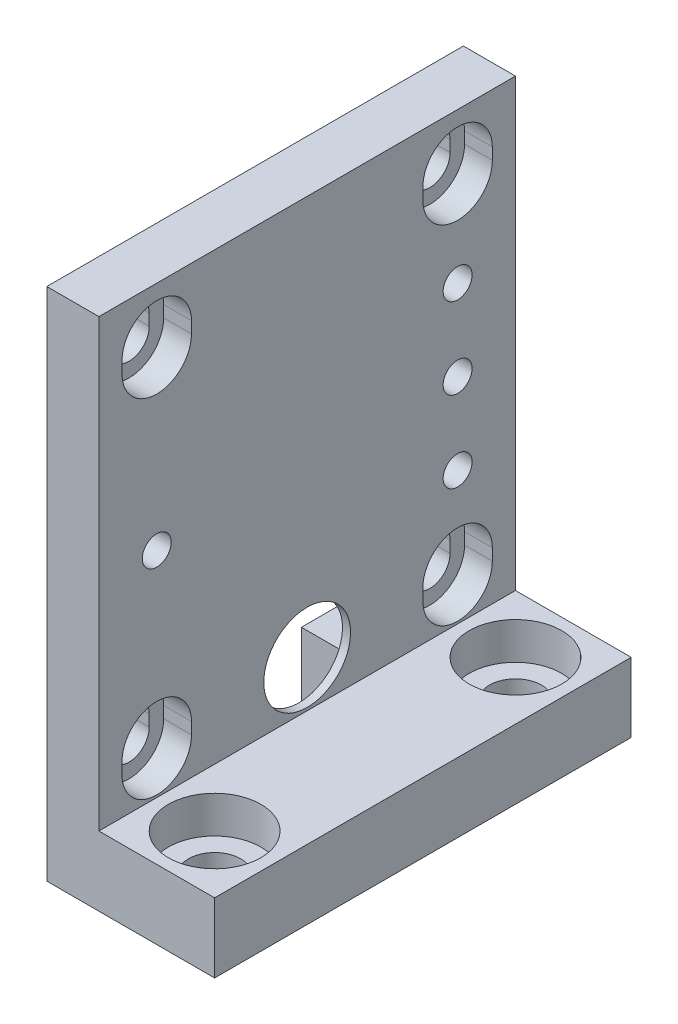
ISO-10303-21;
HEADER;
FILE_DESCRIPTION(('STEP AP214'),'2;1');
FILE_NAME('part.step','',(''),(''),'','','');
FILE_SCHEMA(('AUTOMOTIVE_DESIGN { 1 0 10303 214 1 1 1 1 }'));
ENDSEC;
DATA;
#1=APPLICATION_CONTEXT('core data for automotive mechanical design processes');
#2=APPLICATION_PROTOCOL_DEFINITION('international standard','automotive_design',2000,#1);
#3=PRODUCT_CONTEXT('',#1,'mechanical');
#4=PRODUCT('Part','Part','',(#3));
#5=PRODUCT_RELATED_PRODUCT_CATEGORY('part','',(#4));
#6=PRODUCT_DEFINITION_FORMATION('','',#4);
#7=PRODUCT_DEFINITION_CONTEXT('part definition',#1,'design');
#8=PRODUCT_DEFINITION('design','',#6,#7);
#9=PRODUCT_DEFINITION_SHAPE('','',#8);
#10=(LENGTH_UNIT() NAMED_UNIT(*) SI_UNIT(.MILLI.,.METRE.));
#11=(NAMED_UNIT(*) PLANE_ANGLE_UNIT() SI_UNIT($,.RADIAN.));
#12=(NAMED_UNIT(*) SI_UNIT($,.STERADIAN.) SOLID_ANGLE_UNIT());
#13=UNCERTAINTY_MEASURE_WITH_UNIT(LENGTH_MEASURE(1.E-05),#10,'distance_accuracy_value','');
#14=(GEOMETRIC_REPRESENTATION_CONTEXT(3) GLOBAL_UNCERTAINTY_ASSIGNED_CONTEXT((#13)) GLOBAL_UNIT_ASSIGNED_CONTEXT((#10,
#11,#12)) REPRESENTATION_CONTEXT('',''));
#15=CARTESIAN_POINT('',(0.,0.,0.));
#16=DIRECTION('',(0.,0.,1.));
#17=DIRECTION('',(1.,0.,0.));
#18=AXIS2_PLACEMENT_3D('',#15,#16,#17);
#19=CARTESIAN_POINT('',(8.878093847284,-0.043343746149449,0.5));
#20=CARTESIAN_POINT('',(7.185395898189,1.9571174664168,0.500000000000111));
#21=CARTESIAN_POINT('',(5.492697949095,3.95757867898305,0.5));
#22=CARTESIAN_POINT('',(3.8,5.95803989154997,0.500000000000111));
#23=CARTESIAN_POINT('',(8.878093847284,0.0124722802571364,0.16978793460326));
#24=CARTESIAN_POINT('',(7.185395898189,2.01293349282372,0.169787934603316));
#25=CARTESIAN_POINT('',(5.492697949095,4.01339470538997,0.169787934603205));
#26=CARTESIAN_POINT('',(3.8,6.01385591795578,0.16978793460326));
#27=CARTESIAN_POINT('',(8.878093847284,0.0124722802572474,-0.169787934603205));
#28=CARTESIAN_POINT('',(7.185395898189,2.01293349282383,-0.169787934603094));
#29=CARTESIAN_POINT('',(5.492697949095,4.01339470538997,-0.169787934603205));
#30=CARTESIAN_POINT('',(3.8,6.01385591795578,-0.169787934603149));
#31=CARTESIAN_POINT('',(8.878093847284,-0.043343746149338,-0.5));
#32=CARTESIAN_POINT('',(7.185395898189,1.95711746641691,-0.499999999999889));
#33=CARTESIAN_POINT('',(5.492697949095,3.95757867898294,-0.5));
#34=CARTESIAN_POINT('',(3.8,5.95803989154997,-0.5));
#35=B_SPLINE_SURFACE_WITH_KNOTS('',3,3,((#19,#20,#21,#22),(#23,#24,#25,#26),(#27,#28,#29,#30),
(#31,#32,#33,#34)),.UNSPECIFIED.,.F.,.F.,.F.,(4,4),(4,4),(0.,1.),(0.07671020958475,1.),.UNSPECIFIED.);
#36=DIRECTION('',(0.645942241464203,-0.763386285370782,0.));
#37=VECTOR('',#36,1.);
#38=CARTESIAN_POINT('',(6.36387337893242,2.92800771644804,-0.5));
#39=LINE('',#38,#37);
#40=CARTESIAN_POINT('',(3.8,5.95803989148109,-0.500000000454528));
#41=VERTEX_POINT('',#40);
#42=CARTESIAN_POINT('',(8.84141836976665,-1.12479963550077E-13,-0.499999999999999));
#43=VERTEX_POINT('',#42);
#44=EDGE_CURVE('E419',#41,#43,#39,.T.);
#45=CARTESIAN_POINT('',(8.841418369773,0.,0.500000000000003));
#46=CARTESIAN_POINT('',(8.85344059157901,-1.03921878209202E-13,0.415883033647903));
#47=CARTESIAN_POINT('',(8.86239079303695,-1.09067389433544E-13,0.331332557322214));
#48=CARTESIAN_POINT('',(8.87418286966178,-1.12986708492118E-13,0.161807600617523));
#49=CARTESIAN_POINT('',(8.87702486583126,-1.11760642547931E-13,0.0768331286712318));
#50=CARTESIAN_POINT('',(8.8766429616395,-1.10290219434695E-13,-0.090367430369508));
#51=CARTESIAN_POINT('',(8.87361121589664,-1.10015556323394E-13,-0.172594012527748));
#52=CARTESIAN_POINT('',(8.86182190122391,-1.12029624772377E-13,-0.336682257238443));
#53=CARTESIAN_POINT('',(8.85306105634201,-1.14319823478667E-13,-0.418543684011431));
#54=CARTESIAN_POINT('',(8.84141836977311,-1.18727206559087E-13,-0.499999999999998));
#55=B_SPLINE_CURVE_WITH_KNOTS('',3,(#45,#46,#47,#48,#49,#50,#51,#52,#53,#54),.UNSPECIFIED.,.F.,
.F.,(4,2,2,2,4),(0.,0.254851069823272,0.509697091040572,0.756346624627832,1.00313731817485),.UNSPECIFIED.);
#56=CARTESIAN_POINT('',(8.84141836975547,-1.01474037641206E-13,0.500000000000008));
#57=VERTEX_POINT('',#56);
#58=EDGE_CURVE('E23',#57,#43,#55,.T.);
#59=DIRECTION('',(-0.645942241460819,0.763386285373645,0.));
#60=VECTOR('',#59,1.);
#61=CARTESIAN_POINT('',(6.36386808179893,2.92801397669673,0.500000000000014));
#62=LINE('',#61,#60);
#63=CARTESIAN_POINT('',(3.8,5.95803989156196,0.500000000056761));
#64=VERTEX_POINT('',#63);
#65=EDGE_CURVE('E424',#57,#64,#62,.T.);
#66=CARTESIAN_POINT('',(3.8,5.95803989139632,-0.500000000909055));
#67=CARTESIAN_POINT('',(3.8,5.97220440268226,-0.416176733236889));
#68=CARTESIAN_POINT('',(3.8,5.98277635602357,-0.331769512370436));
#69=CARTESIAN_POINT('',(3.80000000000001,5.99672903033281,-0.162363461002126));
#70=CARTESIAN_POINT('',(3.80000000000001,6.00010985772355,-0.0773646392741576));
#71=CARTESIAN_POINT('',(3.8,5.99947034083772,0.172426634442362));
#72=CARTESIAN_POINT('',(3.79999999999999,5.98552686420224,0.337243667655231));
#73=CARTESIAN_POINT('',(3.79999999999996,5.95803989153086,0.500000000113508));
#74=B_SPLINE_CURVE_WITH_KNOTS('',3,(#66,#67,#68,#69,#70,#71,#72,#73),.UNSPECIFIED.,.F.,.F.,(4,2,
2,4),(0.,0.25491446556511,0.509825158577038,1.00395766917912),.UNSPECIFIED.);
#75=EDGE_CURVE('E417',#41,#64,#74,.T.);
#76=ORIENTED_EDGE('',*,*,#44,.T.);
#77=ORIENTED_EDGE('',*,*,#58,.F.);
#78=ORIENTED_EDGE('',*,*,#65,.T.);
#79=ORIENTED_EDGE('',*,*,#75,.F.);
#80=EDGE_LOOP('',(#76,#77,#78,#79));
#81=FACE_BOUND('',#80,.T.);
#82=ADVANCED_FACE('F16',(#81),#35,.F.);
#83=CARTESIAN_POINT('',(4.49999999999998,40.1999999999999,-11.25));
#84=DIRECTION('',(0.,0.,1.));
#85=DIRECTION('',(1.,0.,0.));
#86=AXIS2_PLACEMENT_3D('',#83,#84,#85);
#87=PLANE('',#86);
#88=DIRECTION('',(1.,0.,0.));
#89=VECTOR('',#88,1.);
#90=CARTESIAN_POINT('',(4.5,40.1999999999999,-11.2499999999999));
#91=LINE('',#90,#89);
#92=CARTESIAN_POINT('',(0.,40.1999999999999,-11.2499999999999));
#93=VERTEX_POINT('',#92);
#94=CARTESIAN_POINT('',(2.09999999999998,40.1999999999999,-11.2499999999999));
#95=VERTEX_POINT('',#94);
#96=EDGE_CURVE('E662',#93,#95,#91,.T.);
#97=ORIENTED_EDGE('',*,*,#96,.T.);
#98=DIRECTION('',(0.,1.,0.));
#99=VECTOR('',#98,1.);
#100=CARTESIAN_POINT('',(2.1,40.1999999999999,-11.25));
#101=LINE('',#100,#99);
#102=CARTESIAN_POINT('',(2.1,39.2,-11.2499999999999));
#103=VERTEX_POINT('',#102);
#104=EDGE_CURVE('E568',#103,#95,#101,.T.);
#105=ORIENTED_EDGE('',*,*,#104,.F.);
#106=DIRECTION('',(1.,0.,0.));
#107=VECTOR('',#106,1.);
#108=CARTESIAN_POINT('',(4.5,39.2,-11.2499999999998));
#109=LINE('',#108,#107);
#110=CARTESIAN_POINT('',(0.,39.2,-11.2499999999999));
#111=VERTEX_POINT('',#110);
#112=EDGE_CURVE('E665',#103,#111,#109,.F.);
#113=ORIENTED_EDGE('',*,*,#112,.T.);
#114=DIRECTION('',(0.,1.,0.));
#115=VECTOR('',#114,1.);
#116=CARTESIAN_POINT('',(0.,40.1999999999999,-11.25));
#117=LINE('',#116,#115);
#118=EDGE_CURVE('E732',#93,#111,#117,.F.);
#119=ORIENTED_EDGE('',*,*,#118,.F.);
#120=EDGE_LOOP('',(#97,#105,#113,#119));
#121=FACE_BOUND('',#120,.T.);
#122=ADVANCED_FACE('F556',(#121),#87,.F.);
#123=CARTESIAN_POINT('',(4.5,39.1999999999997,-14.75));
#124=DIRECTION('',(0.,0.,-1.));
#125=DIRECTION('',(-1.,0.,0.));
#126=AXIS2_PLACEMENT_3D('',#123,#124,#125);
#127=PLANE('',#126);
#128=DIRECTION('',(1.,0.,0.));
#129=VECTOR('',#128,1.);
#130=CARTESIAN_POINT('',(4.5,39.1999999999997,-14.7499999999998));
#131=LINE('',#130,#129);
#132=CARTESIAN_POINT('',(0.,39.1999999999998,-14.7499999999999));
#133=VERTEX_POINT('',#132);
#134=CARTESIAN_POINT('',(2.1,39.1999999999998,-14.7499999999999));
#135=VERTEX_POINT('',#134);
#136=EDGE_CURVE('E423',#133,#135,#131,.T.);
#137=ORIENTED_EDGE('',*,*,#136,.T.);
#138=DIRECTION('',(0.,1.,0.));
#139=VECTOR('',#138,1.);
#140=CARTESIAN_POINT('',(2.1,39.1999999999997,-14.75));
#141=LINE('',#140,#139);
#142=CARTESIAN_POINT('',(2.09999999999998,40.2,-14.7499999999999));
#143=VERTEX_POINT('',#142);
#144=EDGE_CURVE('E730',#143,#135,#141,.F.);
#145=ORIENTED_EDGE('',*,*,#144,.F.);
#146=DIRECTION('',(1.,0.,0.));
#147=VECTOR('',#146,1.);
#148=CARTESIAN_POINT('',(4.5,40.2,-14.7499999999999));
#149=LINE('',#148,#147);
#150=CARTESIAN_POINT('',(0.,40.2,-14.7499999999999));
#151=VERTEX_POINT('',#150);
#152=EDGE_CURVE('E659',#143,#151,#149,.F.);
#153=ORIENTED_EDGE('',*,*,#152,.T.);
#154=DIRECTION('',(0.,1.,0.));
#155=VECTOR('',#154,1.);
#156=CARTESIAN_POINT('',(0.,39.1999999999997,-14.75));
#157=LINE('',#156,#155);
#158=EDGE_CURVE('E729',#133,#151,#157,.T.);
#159=ORIENTED_EDGE('',*,*,#158,.F.);
#160=EDGE_LOOP('',(#137,#145,#153,#159));
#161=FACE_BOUND('',#160,.T.);
#162=ADVANCED_FACE('F1768',(#161),#127,.F.);
#163=CARTESIAN_POINT('',(4.5,10.2,-11.25));
#164=DIRECTION('',(0.,0.,1.));
#165=DIRECTION('',(1.,0.,0.));
#166=AXIS2_PLACEMENT_3D('',#163,#164,#165);
#167=PLANE('',#166);
#168=DIRECTION('',(1.,0.,0.));
#169=VECTOR('',#168,1.);
#170=CARTESIAN_POINT('',(4.5,10.2,-11.25));
#171=LINE('',#170,#169);
#172=CARTESIAN_POINT('',(0.,10.2,-11.25));
#173=VERTEX_POINT('',#172);
#174=CARTESIAN_POINT('',(2.1,10.2,-11.25));
#175=VERTEX_POINT('',#174);
#176=EDGE_CURVE('E650',#173,#175,#171,.T.);
#177=ORIENTED_EDGE('',*,*,#176,.T.);
#178=DIRECTION('',(0.,1.,0.));
#179=VECTOR('',#178,1.);
#180=CARTESIAN_POINT('',(2.1,10.2,-11.25));
#181=LINE('',#180,#179);
#182=CARTESIAN_POINT('',(2.1,9.19999999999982,-11.25));
#183=VERTEX_POINT('',#182);
#184=EDGE_CURVE('E727',#183,#175,#181,.T.);
#185=ORIENTED_EDGE('',*,*,#184,.F.);
#186=DIRECTION('',(1.,0.,0.));
#187=VECTOR('',#186,1.);
#188=CARTESIAN_POINT('',(4.5,9.19999999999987,-11.25));
#189=LINE('',#188,#187);
#190=CARTESIAN_POINT('',(0.,9.19999999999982,-11.25));
#191=VERTEX_POINT('',#190);
#192=EDGE_CURVE('E653',#183,#191,#189,.F.);
#193=ORIENTED_EDGE('',*,*,#192,.T.);
#194=DIRECTION('',(0.,1.,0.));
#195=VECTOR('',#194,1.);
#196=CARTESIAN_POINT('',(0.,10.2,-11.25));
#197=LINE('',#196,#195);
#198=EDGE_CURVE('E724',#173,#191,#197,.F.);
#199=ORIENTED_EDGE('',*,*,#198,.F.);
#200=EDGE_LOOP('',(#177,#185,#193,#199));
#201=FACE_BOUND('',#200,.T.);
#202=ADVANCED_FACE('F1759',(#201),#167,.F.);
#203=CARTESIAN_POINT('',(4.5,9.19999999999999,-14.7499999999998));
#204=DIRECTION('',(0.,0.,-1.));
#205=DIRECTION('',(-1.,0.,0.));
#206=AXIS2_PLACEMENT_3D('',#203,#204,#205);
#207=PLANE('',#206);
#208=DIRECTION('',(1.,0.,0.));
#209=VECTOR('',#208,1.);
#210=CARTESIAN_POINT('',(4.5,9.19999999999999,-14.75));
#211=LINE('',#210,#209);
#212=CARTESIAN_POINT('',(0.,9.19999999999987,-14.7499999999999));
#213=VERTEX_POINT('',#212);
#214=CARTESIAN_POINT('',(2.1,9.19999999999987,-14.7499999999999));
#215=VERTEX_POINT('',#214);
#216=EDGE_CURVE('E656',#213,#215,#211,.T.);
#217=ORIENTED_EDGE('',*,*,#216,.T.);
#218=DIRECTION('',(0.,1.,0.));
#219=VECTOR('',#218,1.);
#220=CARTESIAN_POINT('',(2.1,9.19999999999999,-14.7499999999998));
#221=LINE('',#220,#219);
#222=CARTESIAN_POINT('',(2.1,10.1999999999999,-14.7499999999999));
#223=VERTEX_POINT('',#222);
#224=EDGE_CURVE('E722',#223,#215,#221,.F.);
#225=ORIENTED_EDGE('',*,*,#224,.F.);
#226=DIRECTION('',(1.,0.,0.));
#227=VECTOR('',#226,1.);
#228=CARTESIAN_POINT('',(4.5,10.1999999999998,-14.75));
#229=LINE('',#228,#227);
#230=CARTESIAN_POINT('',(0.,10.1999999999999,-14.7499999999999));
#231=VERTEX_POINT('',#230);
#232=EDGE_CURVE('E647',#223,#231,#229,.F.);
#233=ORIENTED_EDGE('',*,*,#232,.T.);
#234=DIRECTION('',(0.,1.,0.));
#235=VECTOR('',#234,1.);
#236=CARTESIAN_POINT('',(0.,9.19999999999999,-14.7499999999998));
#237=LINE('',#236,#235);
#238=EDGE_CURVE('E721',#213,#231,#237,.T.);
#239=ORIENTED_EDGE('',*,*,#238,.F.);
#240=EDGE_LOOP('',(#217,#225,#233,#239));
#241=FACE_BOUND('',#240,.T.);
#242=ADVANCED_FACE('F1750',(#241),#207,.F.);
#243=CARTESIAN_POINT('',(4.5,40.1999999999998,14.75));
#244=DIRECTION('',(0.,0.,1.));
#245=DIRECTION('',(1.,0.,0.));
#246=AXIS2_PLACEMENT_3D('',#243,#244,#245);
#247=PLANE('',#246);
#248=DIRECTION('',(1.,0.,0.));
#249=VECTOR('',#248,1.);
#250=CARTESIAN_POINT('',(4.5,40.1999999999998,14.7500000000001));
#251=LINE('',#250,#249);
#252=CARTESIAN_POINT('',(0.,40.1999999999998,14.7500000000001));
#253=VERTEX_POINT('',#252);
#254=CARTESIAN_POINT('',(2.1,40.1999999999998,14.7500000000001));
#255=VERTEX_POINT('',#254);
#256=EDGE_CURVE('E638',#253,#255,#251,.T.);
#257=ORIENTED_EDGE('',*,*,#256,.T.);
#258=DIRECTION('',(0.,1.,0.));
#259=VECTOR('',#258,1.);
#260=CARTESIAN_POINT('',(2.1,40.1999999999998,14.75));
#261=LINE('',#260,#259);
#262=CARTESIAN_POINT('',(2.1,39.2,14.7500000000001));
#263=VERTEX_POINT('',#262);
#264=EDGE_CURVE('E719',#263,#255,#261,.T.);
#265=ORIENTED_EDGE('',*,*,#264,.F.);
#266=DIRECTION('',(1.,0.,0.));
#267=VECTOR('',#266,1.);
#268=CARTESIAN_POINT('',(4.5,39.2000000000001,14.7500000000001));
#269=LINE('',#268,#267);
#270=CARTESIAN_POINT('',(0.,39.2,14.7500000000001));
#271=VERTEX_POINT('',#270);
#272=EDGE_CURVE('E641',#263,#271,#269,.F.);
#273=ORIENTED_EDGE('',*,*,#272,.T.);
#274=DIRECTION('',(0.,1.,0.));
#275=VECTOR('',#274,1.);
#276=CARTESIAN_POINT('',(0.,40.1999999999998,14.75));
#277=LINE('',#276,#275);
#278=EDGE_CURVE('E716',#253,#271,#277,.F.);
#279=ORIENTED_EDGE('',*,*,#278,.F.);
#280=EDGE_LOOP('',(#257,#265,#273,#279));
#281=FACE_BOUND('',#280,.T.);
#282=ADVANCED_FACE('F1741',(#281),#247,.F.);
#283=CARTESIAN_POINT('',(4.5,39.2,11.25));
#284=DIRECTION('',(0.,0.,-1.));
#285=DIRECTION('',(-1.,0.,0.));
#286=AXIS2_PLACEMENT_3D('',#283,#284,#285);
#287=PLANE('',#286);
#288=DIRECTION('',(1.,0.,0.));
#289=VECTOR('',#288,1.);
#290=CARTESIAN_POINT('',(4.5,39.2,11.2500000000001));
#291=LINE('',#290,#289);
#292=CARTESIAN_POINT('',(0.,39.1999999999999,11.2500000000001));
#293=VERTEX_POINT('',#292);
#294=CARTESIAN_POINT('',(2.1,39.1999999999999,11.2500000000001));
#295=VERTEX_POINT('',#294);
#296=EDGE_CURVE('E644',#293,#295,#291,.T.);
#297=ORIENTED_EDGE('',*,*,#296,.T.);
#298=DIRECTION('',(0.,1.,0.));
#299=VECTOR('',#298,1.);
#300=CARTESIAN_POINT('',(2.1,39.2,11.25));
#301=LINE('',#300,#299);
#302=CARTESIAN_POINT('',(2.1,40.1999999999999,11.2500000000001));
#303=VERTEX_POINT('',#302);
#304=EDGE_CURVE('E714',#303,#295,#301,.F.);
#305=ORIENTED_EDGE('',*,*,#304,.F.);
#306=DIRECTION('',(1.,0.,0.));
#307=VECTOR('',#306,1.);
#308=CARTESIAN_POINT('',(4.5,40.1999999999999,11.2500000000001));
#309=LINE('',#308,#307);
#310=CARTESIAN_POINT('',(0.,40.1999999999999,11.2500000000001));
#311=VERTEX_POINT('',#310);
#312=EDGE_CURVE('E635',#303,#311,#309,.F.);
#313=ORIENTED_EDGE('',*,*,#312,.T.);
#314=DIRECTION('',(0.,1.,0.));
#315=VECTOR('',#314,1.);
#316=CARTESIAN_POINT('',(0.,39.2,11.25));
#317=LINE('',#316,#315);
#318=EDGE_CURVE('E713',#293,#311,#317,.T.);
#319=ORIENTED_EDGE('',*,*,#318,.F.);
#320=EDGE_LOOP('',(#297,#305,#313,#319));
#321=FACE_BOUND('',#320,.T.);
#322=ADVANCED_FACE('F1732',(#321),#287,.F.);
#323=CARTESIAN_POINT('',(4.5,10.2,14.7500000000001));
#324=DIRECTION('',(0.,0.,1.));
#325=DIRECTION('',(1.,0.,0.));
#326=AXIS2_PLACEMENT_3D('',#323,#324,#325);
#327=PLANE('',#326);
#328=DIRECTION('',(1.,0.,0.));
#329=VECTOR('',#328,1.);
#330=CARTESIAN_POINT('',(4.5,10.2,14.7500000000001));
#331=LINE('',#330,#329);
#332=CARTESIAN_POINT('',(0.,10.2,14.7500000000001));
#333=VERTEX_POINT('',#332);
#334=CARTESIAN_POINT('',(2.1,10.2,14.7500000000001));
#335=VERTEX_POINT('',#334);
#336=EDGE_CURVE('E626',#333,#335,#331,.T.);
#337=ORIENTED_EDGE('',*,*,#336,.T.);
#338=DIRECTION('',(0.,1.,0.));
#339=VECTOR('',#338,1.);
#340=CARTESIAN_POINT('',(2.1,10.2,14.7500000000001));
#341=LINE('',#340,#339);
#342=CARTESIAN_POINT('',(2.1,9.19999999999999,14.7500000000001));
#343=VERTEX_POINT('',#342);
#344=EDGE_CURVE('E711',#343,#335,#341,.T.);
#345=ORIENTED_EDGE('',*,*,#344,.F.);
#346=DIRECTION('',(1.,0.,0.));
#347=VECTOR('',#346,1.);
#348=CARTESIAN_POINT('',(4.5,9.19999999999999,14.7500000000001));
#349=LINE('',#348,#347);
#350=CARTESIAN_POINT('',(0.,9.19999999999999,14.7500000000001));
#351=VERTEX_POINT('',#350);
#352=EDGE_CURVE('E629',#343,#351,#349,.F.);
#353=ORIENTED_EDGE('',*,*,#352,.T.);
#354=DIRECTION('',(0.,1.,0.));
#355=VECTOR('',#354,1.);
#356=CARTESIAN_POINT('',(0.,10.2,14.7500000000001));
#357=LINE('',#356,#355);
#358=EDGE_CURVE('E708',#333,#351,#357,.F.);
#359=ORIENTED_EDGE('',*,*,#358,.F.);
#360=EDGE_LOOP('',(#337,#345,#353,#359));
#361=FACE_BOUND('',#360,.T.);
#362=ADVANCED_FACE('F1723',(#361),#327,.F.);
#363=CARTESIAN_POINT('',(4.5,9.19999999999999,11.25));
#364=DIRECTION('',(0.,0.,-1.));
#365=DIRECTION('',(-1.,0.,0.));
#366=AXIS2_PLACEMENT_3D('',#363,#364,#365);
#367=PLANE('',#366);
#368=DIRECTION('',(1.,0.,0.));
#369=VECTOR('',#368,1.);
#370=CARTESIAN_POINT('',(4.5,9.19999999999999,11.2500000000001));
#371=LINE('',#370,#369);
#372=CARTESIAN_POINT('',(0.,9.19999999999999,11.25));
#373=VERTEX_POINT('',#372);
#374=CARTESIAN_POINT('',(2.1,9.19999999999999,11.25));
#375=VERTEX_POINT('',#374);
#376=EDGE_CURVE('E632',#373,#375,#371,.T.);
#377=ORIENTED_EDGE('',*,*,#376,.T.);
#378=DIRECTION('',(0.,1.,0.));
#379=VECTOR('',#378,1.);
#380=CARTESIAN_POINT('',(2.1,9.19999999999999,11.25));
#381=LINE('',#380,#379);
#382=CARTESIAN_POINT('',(2.1,10.1999999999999,11.25));
#383=VERTEX_POINT('',#382);
#384=EDGE_CURVE('E706',#383,#375,#381,.F.);
#385=ORIENTED_EDGE('',*,*,#384,.F.);
#386=DIRECTION('',(1.,0.,0.));
#387=VECTOR('',#386,1.);
#388=CARTESIAN_POINT('',(4.5,10.1999999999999,11.2500000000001));
#389=LINE('',#388,#387);
#390=CARTESIAN_POINT('',(0.,10.1999999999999,11.25));
#391=VERTEX_POINT('',#390);
#392=EDGE_CURVE('E596',#383,#391,#389,.F.);
#393=ORIENTED_EDGE('',*,*,#392,.T.);
#394=DIRECTION('',(0.,1.,0.));
#395=VECTOR('',#394,1.);
#396=CARTESIAN_POINT('',(0.,9.19999999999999,11.25));
#397=LINE('',#396,#395);
#398=EDGE_CURVE('E703',#373,#391,#397,.T.);
#399=ORIENTED_EDGE('',*,*,#398,.F.);
#400=EDGE_LOOP('',(#377,#385,#393,#399));
#401=FACE_BOUND('',#400,.T.);
#402=ADVANCED_FACE('F1715',(#401),#367,.F.);
#403=CARTESIAN_POINT('',(0.999999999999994,-1.11022302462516E-13,-17.9999999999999));
#404=DIRECTION('',(-1.,0.,0.));
#405=DIRECTION('',(0.,-1.,0.));
#406=AXIS2_PLACEMENT_3D('',#403,#404,#405);
#407=PLANE('',#406);
#408=DIRECTION('',(0.,0.,1.));
#409=VECTOR('',#408,1.);
#410=CARTESIAN_POINT('',(0.999999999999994,8.00000000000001,-17.9999999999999));
#411=LINE('',#410,#409);
#412=CARTESIAN_POINT('',(0.999999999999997,8.00000000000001,-7.89999999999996));
#413=VERTEX_POINT('',#412);
#414=CARTESIAN_POINT('',(0.999999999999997,8.00000000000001,-6.50000000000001));
#415=VERTEX_POINT('',#414);
#416=EDGE_CURVE('E696',#413,#415,#411,.T.);
#417=ORIENTED_EDGE('',*,*,#416,.T.);
#418=CARTESIAN_POINT('',(1.,10.9999999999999,-6.50000000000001));
#419=DIRECTION('',(-1.,0.,0.));
#420=DIRECTION('',(0.,-1.,0.));
#421=AXIS2_PLACEMENT_3D('',#418,#419,#420);
#422=CIRCLE('',#421,3.);
#423=CARTESIAN_POINT('',(1.,10.9999999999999,-9.50000000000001));
#424=VERTEX_POINT('',#423);
#425=EDGE_CURVE('E582',#415,#424,#422,.F.);
#426=ORIENTED_EDGE('',*,*,#425,.T.);
#427=DIRECTION('',(0.,1.,0.));
#428=VECTOR('',#427,1.);
#429=CARTESIAN_POINT('',(1.,39.9999999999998,-9.50000000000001));
#430=LINE('',#429,#428);
#431=CARTESIAN_POINT('',(0.99999999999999,39.9999999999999,-9.50000000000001));
#432=VERTEX_POINT('',#431);
#433=EDGE_CURVE('E581',#424,#432,#430,.T.);
#434=ORIENTED_EDGE('',*,*,#433,.T.);
#435=CARTESIAN_POINT('',(0.99999999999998,40.,-6.49999999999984));
#436=DIRECTION('',(-1.,0.,0.));
#437=DIRECTION('',(0.,-1.,0.));
#438=AXIS2_PLACEMENT_3D('',#435,#436,#437);
#439=CIRCLE('',#438,3.);
#440=CARTESIAN_POINT('',(0.99999999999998,43.,-6.49999999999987));
#441=VERTEX_POINT('',#440);
#442=EDGE_CURVE('E578',#432,#441,#439,.F.);
#443=ORIENTED_EDGE('',*,*,#442,.T.);
#444=DIRECTION('',(0.,0.,1.));
#445=VECTOR('',#444,1.);
#446=CARTESIAN_POINT('',(0.999999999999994,43.,-17.9999999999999));
#447=LINE('',#446,#445);
#448=CARTESIAN_POINT('',(0.999999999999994,43.,-7.89999999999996));
#449=VERTEX_POINT('',#448);
#450=EDGE_CURVE('E701',#441,#449,#447,.F.);
#451=ORIENTED_EDGE('',*,*,#450,.T.);
#452=CARTESIAN_POINT('',(0.999999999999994,39.8999999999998,-7.89999999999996));
#453=DIRECTION('',(-1.,0.,0.));
#454=DIRECTION('',(0.,-1.,0.));
#455=AXIS2_PLACEMENT_3D('',#452,#453,#454);
#456=CIRCLE('',#455,3.1);
#457=CARTESIAN_POINT('',(0.999999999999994,39.8999999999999,-11.));
#458=VERTEX_POINT('',#457);
#459=EDGE_CURVE('E597',#449,#458,#456,.T.);
#460=ORIENTED_EDGE('',*,*,#459,.T.);
#461=DIRECTION('',(0.,1.,0.));
#462=VECTOR('',#461,1.);
#463=CARTESIAN_POINT('',(0.99999999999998,39.8999999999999,-11.));
#464=LINE('',#463,#462);
#465=CARTESIAN_POINT('',(0.99999999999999,11.0999999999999,-11.));
#466=VERTEX_POINT('',#465);
#467=EDGE_CURVE('E622',#458,#466,#464,.F.);
#468=ORIENTED_EDGE('',*,*,#467,.T.);
#469=CARTESIAN_POINT('',(1.,11.1,-7.89999999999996));
#470=DIRECTION('',(-1.,0.,0.));
#471=DIRECTION('',(0.,-1.,0.));
#472=AXIS2_PLACEMENT_3D('',#469,#470,#471);
#473=CIRCLE('',#472,3.1);
#474=EDGE_CURVE('E592',#466,#413,#473,.T.);
#475=ORIENTED_EDGE('',*,*,#474,.T.);
#476=EDGE_LOOP('',(#417,#426,#434,#443,#451,#460,#468,#475));
#477=FACE_BOUND('',#476,.T.);
#478=ADVANCED_FACE('F1039',(#477),#407,.T.);
#479=CARTESIAN_POINT('',(0.999999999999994,-1.11022302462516E-13,-17.9999999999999));
#480=DIRECTION('',(-1.,0.,0.));
#481=DIRECTION('',(0.,-1.,0.));
#482=AXIS2_PLACEMENT_3D('',#479,#480,#481);
#483=PLANE('',#482);
#484=DIRECTION('',(0.,0.,1.));
#485=VECTOR('',#484,1.);
#486=CARTESIAN_POINT('',(1.,42.9999999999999,6.50000000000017));
#487=LINE('',#486,#485);
#488=CARTESIAN_POINT('',(1.,43.,7.9000000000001));
#489=VERTEX_POINT('',#488);
#490=CARTESIAN_POINT('',(1.,42.9999999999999,6.50000000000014));
#491=VERTEX_POINT('',#490);
#492=EDGE_CURVE('E615',#489,#491,#487,.F.);
#493=ORIENTED_EDGE('',*,*,#492,.T.);
#494=CARTESIAN_POINT('',(1.,39.9999999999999,6.50000000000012));
#495=DIRECTION('',(-1.,0.,0.));
#496=DIRECTION('',(0.,-1.,0.));
#497=AXIS2_PLACEMENT_3D('',#494,#495,#496);
#498=CIRCLE('',#497,3.);
#499=CARTESIAN_POINT('',(1.,39.9999999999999,9.50000000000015));
#500=VERTEX_POINT('',#499);
#501=EDGE_CURVE('E574',#491,#500,#498,.F.);
#502=ORIENTED_EDGE('',*,*,#501,.T.);
#503=DIRECTION('',(0.,1.,0.));
#504=VECTOR('',#503,1.);
#505=CARTESIAN_POINT('',(1.,10.9999999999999,9.50000000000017));
#506=LINE('',#505,#504);
#507=CARTESIAN_POINT('',(1.,10.9999999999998,9.50000000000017));
#508=VERTEX_POINT('',#507);
#509=EDGE_CURVE('E572',#500,#508,#506,.F.);
#510=ORIENTED_EDGE('',*,*,#509,.T.);
#511=CARTESIAN_POINT('',(1.,10.9999999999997,6.50000000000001));
#512=DIRECTION('',(-1.,0.,0.));
#513=DIRECTION('',(0.,-1.,0.));
#514=AXIS2_PLACEMENT_3D('',#511,#512,#513);
#515=CIRCLE('',#514,3.);
#516=CARTESIAN_POINT('',(1.,7.9999999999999,6.50000000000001));
#517=VERTEX_POINT('',#516);
#518=EDGE_CURVE('E569',#508,#517,#515,.F.);
#519=ORIENTED_EDGE('',*,*,#518,.T.);
#520=DIRECTION('',(0.,0.,1.));
#521=VECTOR('',#520,1.);
#522=CARTESIAN_POINT('',(0.999999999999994,7.99999999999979,-17.9999999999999));
#523=LINE('',#522,#521);
#524=CARTESIAN_POINT('',(0.999999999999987,7.9999999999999,7.9000000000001));
#525=VERTEX_POINT('',#524);
#526=EDGE_CURVE('E573',#517,#525,#523,.T.);
#527=ORIENTED_EDGE('',*,*,#526,.T.);
#528=CARTESIAN_POINT('',(0.999999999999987,11.0999999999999,7.90000000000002));
#529=DIRECTION('',(-1.,0.,0.));
#530=DIRECTION('',(0.,-1.,0.));
#531=AXIS2_PLACEMENT_3D('',#528,#529,#530);
#532=CIRCLE('',#531,3.1);
#533=CARTESIAN_POINT('',(0.999999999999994,11.0999999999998,11.));
#534=VERTEX_POINT('',#533);
#535=EDGE_CURVE('E536',#525,#534,#532,.T.);
#536=ORIENTED_EDGE('',*,*,#535,.T.);
#537=DIRECTION('',(0.,1.,0.));
#538=VECTOR('',#537,1.);
#539=CARTESIAN_POINT('',(1.,11.0999999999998,11.));
#540=LINE('',#539,#538);
#541=CARTESIAN_POINT('',(1.,39.9,11.));
#542=VERTEX_POINT('',#541);
#543=EDGE_CURVE('E608',#534,#542,#540,.T.);
#544=ORIENTED_EDGE('',*,*,#543,.T.);
#545=CARTESIAN_POINT('',(1.,39.9,7.90000000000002));
#546=DIRECTION('',(-1.,0.,0.));
#547=DIRECTION('',(0.,-1.,0.));
#548=AXIS2_PLACEMENT_3D('',#545,#546,#547);
#549=CIRCLE('',#548,3.1);
#550=EDGE_CURVE('E601',#542,#489,#549,.T.);
#551=ORIENTED_EDGE('',*,*,#550,.T.);
#552=EDGE_LOOP('',(#493,#502,#510,#519,#527,#536,#544,#551));
#553=FACE_BOUND('',#552,.T.);
#554=ADVANCED_FACE('F1014',(#553),#483,.T.);
#555=CARTESIAN_POINT('',(0.,10.9999999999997,6.50000000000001));
#556=DIRECTION('',(-1.,0.,0.));
#557=DIRECTION('',(0.,-1.,0.));
#558=AXIS2_PLACEMENT_3D('',#555,#556,#557);
#559=CYLINDRICAL_SURFACE('',#558,3.);
#560=DIRECTION('',(1.,0.,0.));
#561=VECTOR('',#560,1.);
#562=CARTESIAN_POINT('',(0.,8.00000000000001,6.50000000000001));
#563=LINE('',#562,#561);
#564=CARTESIAN_POINT('',(3.79999999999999,8.00000000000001,6.50000000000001));
#565=VERTEX_POINT('',#564);
#566=EDGE_CURVE('E692',#565,#517,#563,.F.);
#567=ORIENTED_EDGE('',*,*,#566,.T.);
#568=ORIENTED_EDGE('',*,*,#518,.F.);
#569=DIRECTION('',(1.,0.,0.));
#570=VECTOR('',#569,1.);
#571=CARTESIAN_POINT('',(0.,10.9999999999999,9.50000000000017));
#572=LINE('',#571,#570);
#573=CARTESIAN_POINT('',(3.79999999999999,10.9999999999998,9.50000000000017));
#574=VERTEX_POINT('',#573);
#575=EDGE_CURVE('E577',#508,#574,#572,.T.);
#576=ORIENTED_EDGE('',*,*,#575,.T.);
#577=CARTESIAN_POINT('',(3.79999999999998,10.9999999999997,6.50000000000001));
#578=DIRECTION('',(-1.,0.,0.));
#579=DIRECTION('',(0.,-1.,0.));
#580=AXIS2_PLACEMENT_3D('',#577,#578,#579);
#581=CIRCLE('',#580,3.);
#582=EDGE_CURVE('E534',#565,#574,#581,.T.);
#583=ORIENTED_EDGE('',*,*,#582,.F.);
#584=EDGE_LOOP('',(#567,#568,#576,#583));
#585=FACE_BOUND('',#584,.T.);
#586=ADVANCED_FACE('F1086',(#585),#559,.F.);
#587=CARTESIAN_POINT('',(0.,10.9999999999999,9.50000000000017));
#588=DIRECTION('',(0.,0.,1.));
#589=DIRECTION('',(1.,0.,0.));
#590=AXIS2_PLACEMENT_3D('',#587,#588,#589);
#591=PLANE('',#590);
#592=ORIENTED_EDGE('',*,*,#575,.F.);
#593=ORIENTED_EDGE('',*,*,#509,.F.);
#594=DIRECTION('',(-1.,0.,0.));
#595=VECTOR('',#594,1.);
#596=CARTESIAN_POINT('',(0.,39.9999999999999,9.50000000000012));
#597=LINE('',#596,#595);
#598=CARTESIAN_POINT('',(3.8,39.9999999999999,9.50000000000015));
#599=VERTEX_POINT('',#598);
#600=EDGE_CURVE('E576',#500,#599,#597,.F.);
#601=ORIENTED_EDGE('',*,*,#600,.T.);
#602=DIRECTION('',(0.,-1.,0.));
#603=VECTOR('',#602,1.);
#604=CARTESIAN_POINT('',(3.8,-1.11022302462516E-13,9.50000000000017));
#605=LINE('',#604,#603);
#606=EDGE_CURVE('E963',#574,#599,#605,.F.);
#607=ORIENTED_EDGE('',*,*,#606,.F.);
#608=EDGE_LOOP('',(#592,#593,#601,#607));
#609=FACE_BOUND('',#608,.T.);
#610=ADVANCED_FACE('F1090',(#609),#591,.F.);
#611=CARTESIAN_POINT('',(0.,39.9999999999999,6.50000000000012));
#612=DIRECTION('',(-1.,0.,0.));
#613=DIRECTION('',(0.,-1.,0.));
#614=AXIS2_PLACEMENT_3D('',#611,#612,#613);
#615=CYLINDRICAL_SURFACE('',#614,3.);
#616=ORIENTED_EDGE('',*,*,#600,.F.);
#617=ORIENTED_EDGE('',*,*,#501,.F.);
#618=DIRECTION('',(-1.,0.,0.));
#619=VECTOR('',#618,1.);
#620=CARTESIAN_POINT('',(0.,42.9999999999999,6.50000000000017));
#621=LINE('',#620,#619);
#622=CARTESIAN_POINT('',(3.8,42.9999999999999,6.50000000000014));
#623=VERTEX_POINT('',#622);
#624=EDGE_CURVE('E610',#491,#623,#621,.F.);
#625=ORIENTED_EDGE('',*,*,#624,.T.);
#626=CARTESIAN_POINT('',(3.8,39.9999999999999,6.50000000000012));
#627=DIRECTION('',(-1.,0.,0.));
#628=DIRECTION('',(0.,-1.,0.));
#629=AXIS2_PLACEMENT_3D('',#626,#627,#628);
#630=CIRCLE('',#629,3.);
#631=EDGE_CURVE('E962',#599,#623,#630,.T.);
#632=ORIENTED_EDGE('',*,*,#631,.F.);
#633=EDGE_LOOP('',(#616,#617,#625,#632));
#634=FACE_BOUND('',#633,.T.);
#635=ADVANCED_FACE('F1092',(#634),#615,.F.);
#636=CARTESIAN_POINT('',(0.,40.,-6.49999999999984));
#637=DIRECTION('',(-1.,0.,0.));
#638=DIRECTION('',(0.,-1.,0.));
#639=AXIS2_PLACEMENT_3D('',#636,#637,#638);
#640=CYLINDRICAL_SURFACE('',#639,3.);
#641=DIRECTION('',(-1.,0.,0.));
#642=VECTOR('',#641,1.);
#643=CARTESIAN_POINT('',(0.,42.9999999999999,-6.49999999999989));
#644=LINE('',#643,#642);
#645=CARTESIAN_POINT('',(3.8,42.9999999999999,-6.49999999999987));
#646=VERTEX_POINT('',#645);
#647=EDGE_CURVE('E599',#646,#441,#644,.T.);
#648=ORIENTED_EDGE('',*,*,#647,.T.);
#649=ORIENTED_EDGE('',*,*,#442,.F.);
#650=DIRECTION('',(-1.,0.,0.));
#651=VECTOR('',#650,1.);
#652=CARTESIAN_POINT('',(0.,39.9999999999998,-9.50000000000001));
#653=LINE('',#652,#651);
#654=CARTESIAN_POINT('',(3.8,39.9999999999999,-9.50000000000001));
#655=VERTEX_POINT('',#654);
#656=EDGE_CURVE('E585',#432,#655,#653,.F.);
#657=ORIENTED_EDGE('',*,*,#656,.T.);
#658=CARTESIAN_POINT('',(3.8,40.,-6.49999999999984));
#659=DIRECTION('',(-1.,0.,0.));
#660=DIRECTION('',(0.,-1.,0.));
#661=AXIS2_PLACEMENT_3D('',#658,#659,#660);
#662=CIRCLE('',#661,3.);
#663=EDGE_CURVE('E958',#646,#655,#662,.T.);
#664=ORIENTED_EDGE('',*,*,#663,.F.);
#665=EDGE_LOOP('',(#648,#649,#657,#664));
#666=FACE_BOUND('',#665,.T.);
#667=ADVANCED_FACE('F1046',(#666),#640,.F.);
#668=CARTESIAN_POINT('',(0.,39.9999999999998,-9.50000000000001));
#669=DIRECTION('',(0.,0.,-1.));
#670=DIRECTION('',(-1.,0.,0.));
#671=AXIS2_PLACEMENT_3D('',#668,#669,#670);
#672=PLANE('',#671);
#673=ORIENTED_EDGE('',*,*,#656,.F.);
#674=ORIENTED_EDGE('',*,*,#433,.F.);
#675=DIRECTION('',(-1.,0.,0.));
#676=VECTOR('',#675,1.);
#677=CARTESIAN_POINT('',(0.,10.9999999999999,-9.50000000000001));
#678=LINE('',#677,#676);
#679=CARTESIAN_POINT('',(3.8,10.9999999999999,-9.50000000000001));
#680=VERTEX_POINT('',#679);
#681=EDGE_CURVE('E584',#424,#680,#678,.F.);
#682=ORIENTED_EDGE('',*,*,#681,.T.);
#683=DIRECTION('',(0.,-1.,0.));
#684=VECTOR('',#683,1.);
#685=CARTESIAN_POINT('',(3.8,-1.11022302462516E-13,-9.50000000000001));
#686=LINE('',#685,#684);
#687=EDGE_CURVE('E955',#655,#680,#686,.T.);
#688=ORIENTED_EDGE('',*,*,#687,.F.);
#689=EDGE_LOOP('',(#673,#674,#682,#688));
#690=FACE_BOUND('',#689,.T.);
#691=ADVANCED_FACE('F1100',(#690),#672,.F.);
#692=CARTESIAN_POINT('',(0.,10.9999999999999,-6.50000000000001));
#693=DIRECTION('',(-1.,0.,0.));
#694=DIRECTION('',(0.,-1.,0.));
#695=AXIS2_PLACEMENT_3D('',#692,#693,#694);
#696=CYLINDRICAL_SURFACE('',#695,3.);
#697=ORIENTED_EDGE('',*,*,#681,.F.);
#698=ORIENTED_EDGE('',*,*,#425,.F.);
#699=DIRECTION('',(1.,0.,0.));
#700=VECTOR('',#699,1.);
#701=CARTESIAN_POINT('',(0.,8.00000000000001,-6.50000000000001));
#702=LINE('',#701,#700);
#703=CARTESIAN_POINT('',(3.8,8.00000000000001,-6.50000000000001));
#704=VERTEX_POINT('',#703);
#705=EDGE_CURVE('E684',#415,#704,#702,.T.);
#706=ORIENTED_EDGE('',*,*,#705,.T.);
#707=CARTESIAN_POINT('',(3.8,10.9999999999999,-6.50000000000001));
#708=DIRECTION('',(-1.,0.,0.));
#709=DIRECTION('',(0.,-1.,0.));
#710=AXIS2_PLACEMENT_3D('',#707,#708,#709);
#711=CIRCLE('',#710,3.);
#712=EDGE_CURVE('E952',#680,#704,#711,.T.);
#713=ORIENTED_EDGE('',*,*,#712,.F.);
#714=EDGE_LOOP('',(#697,#698,#706,#713));
#715=FACE_BOUND('',#714,.T.);
#716=ADVANCED_FACE('F1064',(#715),#696,.F.);
#717=CARTESIAN_POINT('',(9.49999999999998,2.79999999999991,13.0000000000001));
#718=DIRECTION('',(0.,-1.,0.));
#719=DIRECTION('',(1.,0.,0.));
#720=AXIS2_PLACEMENT_3D('',#717,#718,#719);
#721=PLANE('',#720);
#722=CARTESIAN_POINT('',(9.49999999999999,2.79999999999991,13.0000000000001));
#723=DIRECTION('',(0.,-1.,0.));
#724=DIRECTION('',(1.,0.,0.));
#725=AXIS2_PLACEMENT_3D('',#722,#723,#724);
#726=CIRCLE('',#725,4.);
#727=CARTESIAN_POINT('',(13.5,2.79999999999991,13.0000000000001));
#728=VERTEX_POINT('',#727);
#729=EDGE_CURVE('E898',#728,#728,#726,.F.);
#730=ORIENTED_EDGE('',*,*,#729,.T.);
#731=EDGE_LOOP('',(#730));
#732=FACE_BOUND('',#731,.T.);
#733=CARTESIAN_POINT('',(9.49999999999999,2.79999999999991,13.0000000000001));
#734=DIRECTION('',(0.,-1.,0.));
#735=DIRECTION('',(1.,0.,0.));
#736=AXIS2_PLACEMENT_3D('',#733,#734,#735);
#737=CIRCLE('',#736,2.25);
#738=CARTESIAN_POINT('',(11.75,2.79999999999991,13.0000000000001));
#739=VERTEX_POINT('',#738);
#740=EDGE_CURVE('E589',#739,#739,#737,.T.);
#741=ORIENTED_EDGE('',*,*,#740,.T.);
#742=EDGE_LOOP('',(#741));
#743=FACE_BOUND('',#742,.T.);
#744=ADVANCED_FACE('F1254',(#732,#743),#721,.F.);
#745=CARTESIAN_POINT('',(9.5,2.79999999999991,-13.));
#746=DIRECTION('',(0.,-1.,0.));
#747=DIRECTION('',(1.,0.,0.));
#748=AXIS2_PLACEMENT_3D('',#745,#746,#747);
#749=PLANE('',#748);
#750=CARTESIAN_POINT('',(9.5,2.79999999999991,-13.));
#751=DIRECTION('',(0.,-1.,0.));
#752=DIRECTION('',(1.,0.,0.));
#753=AXIS2_PLACEMENT_3D('',#750,#751,#752);
#754=CIRCLE('',#753,4.);
#755=CARTESIAN_POINT('',(13.5,2.79999999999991,-13.));
#756=VERTEX_POINT('',#755);
#757=EDGE_CURVE('E1879',#756,#756,#754,.F.);
#758=ORIENTED_EDGE('',*,*,#757,.T.);
#759=EDGE_LOOP('',(#758));
#760=FACE_BOUND('',#759,.T.);
#761=CARTESIAN_POINT('',(9.5,2.79999999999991,-13.));
#762=DIRECTION('',(0.,-1.,0.));
#763=DIRECTION('',(1.,0.,0.));
#764=AXIS2_PLACEMENT_3D('',#761,#762,#763);
#765=CIRCLE('',#764,2.25);
#766=CARTESIAN_POINT('',(11.75,2.79999999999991,-13.));
#767=VERTEX_POINT('',#766);
#768=EDGE_CURVE('E586',#767,#767,#765,.T.);
#769=ORIENTED_EDGE('',*,*,#768,.T.);
#770=EDGE_LOOP('',(#769));
#771=FACE_BOUND('',#770,.T.);
#772=ADVANCED_FACE('F1259',(#760,#771),#749,.F.);
#773=CARTESIAN_POINT('',(9.5,5.99999999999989,-13.));
#774=DIRECTION('',(0.,-1.,0.));
#775=DIRECTION('',(1.,0.,0.));
#776=AXIS2_PLACEMENT_3D('',#773,#774,#775);
#777=CYLINDRICAL_SURFACE('',#776,2.25);
#778=ORIENTED_EDGE('',*,*,#768,.F.);
#779=EDGE_LOOP('',(#778));
#780=FACE_BOUND('',#779,.T.);
#781=CARTESIAN_POINT('',(9.5,0.,-13.));
#782=DIRECTION('',(0.,-1.,0.));
#783=DIRECTION('',(1.,0.,0.));
#784=AXIS2_PLACEMENT_3D('',#781,#782,#783);
#785=CIRCLE('',#784,2.25);
#786=CARTESIAN_POINT('',(11.75,0.,-13.));
#787=VERTEX_POINT('',#786);
#788=EDGE_CURVE('E1882',#787,#787,#785,.F.);
#789=ORIENTED_EDGE('',*,*,#788,.F.);
#790=EDGE_LOOP('',(#789));
#791=FACE_BOUND('',#790,.T.);
#792=ADVANCED_FACE('F1263',(#780,#791),#777,.F.);
#793=CARTESIAN_POINT('',(9.49999999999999,5.99999999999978,13.0000000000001));
#794=DIRECTION('',(0.,-1.,0.));
#795=DIRECTION('',(1.,0.,0.));
#796=AXIS2_PLACEMENT_3D('',#793,#794,#795);
#797=CYLINDRICAL_SURFACE('',#796,2.25);
#798=ORIENTED_EDGE('',*,*,#740,.F.);
#799=EDGE_LOOP('',(#798));
#800=FACE_BOUND('',#799,.T.);
#801=CARTESIAN_POINT('',(9.49999999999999,-3.33066907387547E-13,13.0000000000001));
#802=DIRECTION('',(0.,-1.,0.));
#803=DIRECTION('',(1.,0.,0.));
#804=AXIS2_PLACEMENT_3D('',#801,#802,#803);
#805=CIRCLE('',#804,2.25);
#806=CARTESIAN_POINT('',(11.75,-3.33066907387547E-13,13.0000000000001));
#807=VERTEX_POINT('',#806);
#808=EDGE_CURVE('E892',#807,#807,#805,.F.);
#809=ORIENTED_EDGE('',*,*,#808,.F.);
#810=EDGE_LOOP('',(#809));
#811=FACE_BOUND('',#810,.T.);
#812=ADVANCED_FACE('F543',(#800,#811),#797,.F.);
#813=CARTESIAN_POINT('',(8.92773616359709,-3.06005182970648,4.00000000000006));
#814=CARTESIAN_POINT('',(8.91081294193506,-3.04005165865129,4.00000000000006));
#815=CARTESIAN_POINT('',(8.89388972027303,-3.02005148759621,4.00000000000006));
#816=CARTESIAN_POINT('',(8.876966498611,-3.00005131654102,4.00000000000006));
#817=CARTESIAN_POINT('',(7.184644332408,-1.00003421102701,4.00000000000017));
#818=CARTESIAN_POINT('',(5.492322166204,0.999982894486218,4.00000000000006));
#819=CARTESIAN_POINT('',(3.8,2.99999999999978,4.00000000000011));
#820=CARTESIAN_POINT('',(8.92773616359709,-2.62549072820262,4.00000000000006));
#821=CARTESIAN_POINT('',(8.91081294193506,-2.60549055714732,4.00000000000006));
#822=CARTESIAN_POINT('',(8.89388972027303,-2.58549038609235,4.00000000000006));
#823=CARTESIAN_POINT('',(8.876966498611,-2.56549021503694,4.00000000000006));
#824=CARTESIAN_POINT('',(7.184644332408,-0.565473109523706,4.00000000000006));
#825=CARTESIAN_POINT('',(5.492322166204,1.43454399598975,4.));
#826=CARTESIAN_POINT('',(3.8,3.43456110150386,4.00000000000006));
#827=CARTESIAN_POINT('',(8.92773616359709,-1.75667408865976,3.80816339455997));
#828=CARTESIAN_POINT('',(8.91081294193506,-1.73667391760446,3.80816339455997));
#829=CARTESIAN_POINT('',(8.89388972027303,-1.71667374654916,3.80816339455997));
#830=CARTESIAN_POINT('',(8.876966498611,-1.6966735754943,3.80816339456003));
#831=CARTESIAN_POINT('',(7.184644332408,0.303343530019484,3.80816339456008));
#832=CARTESIAN_POINT('',(5.492322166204,2.30336063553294,3.80816339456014));
#833=CARTESIAN_POINT('',(3.8,4.30337774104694,3.80816339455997));
#834=CARTESIAN_POINT('',(8.92773616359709,-0.695493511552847,2.99841652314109));
#835=CARTESIAN_POINT('',(8.91081294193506,-0.675493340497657,2.99841652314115));
#836=CARTESIAN_POINT('',(8.89388972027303,-0.655493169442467,2.99841652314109));
#837=CARTESIAN_POINT('',(8.876966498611,-0.635492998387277,2.99841652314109));
#838=CARTESIAN_POINT('',(7.184644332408,1.36452410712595,2.99841652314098));
#839=CARTESIAN_POINT('',(5.492322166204,3.36454121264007,2.9984165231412));
#840=CARTESIAN_POINT('',(3.8,5.36455831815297,2.99841652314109));
#841=CARTESIAN_POINT('',(8.92773616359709,-0.0739357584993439,1.81712055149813));
#842=CARTESIAN_POINT('',(8.91081294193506,-0.0539355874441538,1.81712055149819));
#843=CARTESIAN_POINT('',(8.89388972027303,-0.0339354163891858,1.81712055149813));
#844=CARTESIAN_POINT('',(8.876966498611,-0.0139352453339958,1.81712055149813));
#845=CARTESIAN_POINT('',(7.184644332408,1.98608186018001,1.81712055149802));
#846=CARTESIAN_POINT('',(5.492322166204,3.98609896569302,1.81712055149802));
#847=CARTESIAN_POINT('',(3.8,5.98611607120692,1.81712055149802));
#848=CARTESIAN_POINT('',(8.92773616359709,-0.0295850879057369,0.928483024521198));
#849=CARTESIAN_POINT('',(8.91081294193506,-0.00958491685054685,0.928483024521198));
#850=CARTESIAN_POINT('',(8.89388972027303,0.0104152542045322,0.928483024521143));
#851=CARTESIAN_POINT('',(8.876966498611,0.0304154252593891,0.928483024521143));
#852=CARTESIAN_POINT('',(7.184644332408,2.03043253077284,0.928483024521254));
#853=CARTESIAN_POINT('',(5.492322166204,4.03044963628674,0.928483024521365));
#854=CARTESIAN_POINT('',(3.8,6.03046674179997,0.928483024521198));
#855=CARTESIAN_POINT('',(8.92773616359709,-0.102011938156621,0.5));
#856=CARTESIAN_POINT('',(8.91081294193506,-0.0820117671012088,0.5));
#857=CARTESIAN_POINT('',(8.89388972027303,-0.0620115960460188,0.5));
#858=CARTESIAN_POINT('',(8.876966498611,-0.0420114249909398,0.5));
#859=CARTESIAN_POINT('',(7.184644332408,1.95800568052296,0.5));
#860=CARTESIAN_POINT('',(5.492322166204,3.95802278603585,0.5));
#861=CARTESIAN_POINT('',(3.8,5.95803989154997,0.500000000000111));
#862=B_SPLINE_SURFACE_WITH_KNOTS('',3,3,((#813,#814,#815,#816,#817,#818,#819),(#820,#821,#822,
#823,#824,#825,#826),(#827,#828,#829,#830,#831,#832,#833),(#834,#835,#836,#837,#838,#839,#840),
(#841,#842,#843,#844,#845,#846,#847),(#848,#849,#850,#851,#852,#853,#854),(#855,#856,#857,#858,
#859,#860,#861)),.UNSPECIFIED.,.F.,.F.,.F.,(4,1,1,1,4),(4,3,4),(0.,0.25,0.5,0.75,1.),
(0.0676843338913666,0.07691518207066,1.),.UNSPECIFIED.);
#863=CARTESIAN_POINT('',(6.33846153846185,-3.10894972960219E-13,4.00000000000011));
#864=CARTESIAN_POINT('',(6.39060345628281,-2.03642591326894E-13,4.00000165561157));
#865=CARTESIAN_POINT('',(6.44272756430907,-1.40674047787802E-13,3.9980708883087));
#866=CARTESIAN_POINT('',(6.54667862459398,0.,3.99041919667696));
#867=CARTESIAN_POINT('',(6.5985056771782,0.,3.98469963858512));
#868=CARTESIAN_POINT('',(6.75293892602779,-1.62866510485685E-13,3.96200680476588));
#869=CARTESIAN_POINT('',(6.85476936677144,-3.03599480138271E-13,3.93949856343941));
#870=CARTESIAN_POINT('',(7.07153971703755,-3.21802615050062E-13,3.87545910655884));
#871=CARTESIAN_POINT('',(7.18571551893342,-1.49737465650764E-13,3.83131854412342));
#872=CARTESIAN_POINT('',(7.35063029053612,0.,3.75209080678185));
#873=CARTESIAN_POINT('',(7.40458476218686,-1.05690032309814E-13,3.72348367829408));
#874=CARTESIAN_POINT('',(7.51012816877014,-1.16354759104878E-13,3.66219058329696));
#875=CARTESIAN_POINT('',(7.56171702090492,-1.12962195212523E-13,3.62950447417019));
#876=CARTESIAN_POINT('',(7.71940662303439,-1.07053653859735E-13,3.52122983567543));
#877=CARTESIAN_POINT('',(7.82102222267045,-1.0988901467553E-13,3.43900319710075));
#878=CARTESIAN_POINT('',(8.01122839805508,-1.12156029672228E-13,3.26071921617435));
#879=CARTESIAN_POINT('',(8.09981390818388,-1.11586363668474E-13,3.16465652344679));
#880=CARTESIAN_POINT('',(8.22810484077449,-1.11125344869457E-13,3.00477039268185));
#881=CARTESIAN_POINT('',(8.27254066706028,-1.11048293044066E-13,2.94467661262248));
#882=CARTESIAN_POINT('',(8.35669064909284,-1.1099630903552E-13,2.82126528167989));
#883=CARTESIAN_POINT('',(8.39640428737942,-1.11021388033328E-13,2.75794737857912));
#884=CARTESIAN_POINT('',(8.50851019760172,-1.11024131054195E-13,2.56389721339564));
#885=CARTESIAN_POINT('',(8.57388109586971,-1.10929329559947E-13,2.42905122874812));
#886=CARTESIAN_POINT('',(8.69401404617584,-1.10896159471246E-13,2.13137705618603));
#887=CARTESIAN_POINT('',(8.74579490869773,-1.10982891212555E-13,1.96735293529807));
#888=CARTESIAN_POINT('',(8.82404111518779,-1.11061722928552E-13,1.63336485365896));
#889=CARTESIAN_POINT('',(8.85050053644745,-1.11053800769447E-13,1.46339951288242));
#890=CARTESIAN_POINT('',(8.87552324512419,-1.11037000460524E-13,1.160340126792));
#891=CARTESIAN_POINT('',(8.87905496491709,-1.11028747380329E-13,1.02763301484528));
#892=CARTESIAN_POINT('',(8.87327661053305,-1.11019085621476E-13,0.829068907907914));
#893=CARTESIAN_POINT('',(8.86951261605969,-1.11016319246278E-13,0.763021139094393));
#894=CARTESIAN_POINT('',(8.85826530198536,-1.11028286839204E-13,0.631230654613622));
#895=CARTESIAN_POINT('',(8.8507812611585,-1.11043024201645E-13,0.565488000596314));
#896=CARTESIAN_POINT('',(8.84141836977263,-1.11074818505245E-13,0.5));
#897=B_SPLINE_CURVE_WITH_KNOTS('',3,(#863,#864,#865,#866,#867,#868,#869,#870,#871,#872,#873,
#874,#875,#876,#877,#878,#879,#880,#881,#882,#883,#884,#885,#886,#887,#888,#889,#890,#891,#892,
#893,#894,#895,#896),.UNSPECIFIED.,.F.,.F.,(4,2,2,2,2,2,2,2,2,2,2,2,2,2,2,2,4),(0.,
0.15635689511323,0.312657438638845,0.624449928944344,0.989961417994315,1.17301331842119,
1.3560716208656,1.74660270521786,2.13728521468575,2.36129699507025,2.58533330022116,
3.03334056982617,3.5473413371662,4.06146230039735,4.45889601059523,4.65726643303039,
4.85567532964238),.UNSPECIFIED.);
#898=CARTESIAN_POINT('',(6.33846153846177,-2.10958637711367E-13,4.00000000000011));
#899=VERTEX_POINT('',#898);
#900=EDGE_CURVE('E416',#899,#57,#897,.T.);
#901=DIRECTION('',(-0.645942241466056,0.763386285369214,0.));
#902=VECTOR('',#901,1.);
#903=CARTESIAN_POINT('',(6.33846153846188,-3.33066907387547E-13,4.00000000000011));
#904=LINE('',#903,#902);
#905=CARTESIAN_POINT('',(3.8,3.00000000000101,4.00000000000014));
#906=VERTEX_POINT('',#905);
#907=EDGE_CURVE('E674',#899,#906,#904,.T.);
#908=CARTESIAN_POINT('',(3.80000000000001,5.95803989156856,0.500000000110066));
#909=CARTESIAN_POINT('',(3.8,5.97209603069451,0.583156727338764));
#910=CARTESIAN_POINT('',(3.8,5.98258852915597,0.666907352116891));
#911=CARTESIAN_POINT('',(3.8,5.99647829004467,0.834994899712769));
#912=CARTESIAN_POINT('',(3.8,5.99987564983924,0.919331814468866));
#913=CARTESIAN_POINT('',(3.8,5.99960766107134,1.08793088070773));
#914=CARTESIAN_POINT('',(3.8,5.99594749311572,1.17219304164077));
#915=CARTESIAN_POINT('',(3.8,5.98160316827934,1.34011693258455));
#916=CARTESIAN_POINT('',(3.8,5.97091907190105,1.42377866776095));
#917=CARTESIAN_POINT('',(3.8,5.94251283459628,1.59017157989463));
#918=CARTESIAN_POINT('',(3.8,5.92476882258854,1.6728990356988));
#919=CARTESIAN_POINT('',(3.8,5.88225837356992,1.83652570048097));
#920=CARTESIAN_POINT('',(3.8,5.85749211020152,1.91742495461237));
#921=CARTESIAN_POINT('',(3.8,5.80119958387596,2.07682068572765));
#922=CARTESIAN_POINT('',(3.8,5.76967491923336,2.15531772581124));
#923=CARTESIAN_POINT('',(3.8,5.70017531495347,2.30937084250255));
#924=CARTESIAN_POINT('',(3.8,5.66219992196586,2.38492671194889));
#925=CARTESIAN_POINT('',(3.80000000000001,5.53925107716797,2.60591983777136));
#926=CARTESIAN_POINT('',(3.8,5.4449978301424,2.74640652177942));
#927=CARTESIAN_POINT('',(3.8,5.28696307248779,2.94344130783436));
#928=CARTESIAN_POINT('',(3.8,5.23147966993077,3.00686302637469));
#929=CARTESIAN_POINT('',(3.8,5.11532203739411,3.12880813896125));
#930=CARTESIAN_POINT('',(3.8,5.05464745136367,3.18733119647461));
#931=CARTESIAN_POINT('',(3.8,4.9287023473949,3.29902642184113));
#932=CARTESIAN_POINT('',(3.8,4.86343749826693,3.35220499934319));
#933=CARTESIAN_POINT('',(3.8,4.72870424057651,3.45294185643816));
#934=CARTESIAN_POINT('',(3.8,4.65923587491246,3.50050019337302));
#935=CARTESIAN_POINT('',(3.8,4.51653179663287,3.58966472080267));
#936=CARTESIAN_POINT('',(3.8,4.44329437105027,3.63126817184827));
#937=CARTESIAN_POINT('',(3.8,4.29355510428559,3.70810096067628));
#938=CARTESIAN_POINT('',(3.8,4.21705347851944,3.74333071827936));
#939=CARTESIAN_POINT('',(3.8,4.06106843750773,3.80727894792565));
#940=CARTESIAN_POINT('',(3.8,3.98157587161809,3.83597515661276));
#941=CARTESIAN_POINT('',(3.8,3.82048480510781,3.88659943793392));
#942=CARTESIAN_POINT('',(3.8,3.73888592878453,3.90852629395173));
#943=CARTESIAN_POINT('',(3.8,3.49208368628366,3.96385681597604));
#944=CARTESIAN_POINT('',(3.8,3.32439131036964,3.98700749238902));
#945=CARTESIAN_POINT('',(3.8,3.1041480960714,3.99862651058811));
#946=CARTESIAN_POINT('',(3.8,3.05205663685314,4.00000523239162));
#947=CARTESIAN_POINT('',(3.8,2.99999999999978,4.00000000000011));
#948=B_SPLINE_CURVE_WITH_KNOTS('',3,(#908,#909,#910,#911,#912,#913,#914,#915,#916,#917,#918,
#919,#920,#921,#922,#923,#924,#925,#926,#927,#928,#929,#930,#931,#932,#933,#934,#935,#936,#937,
#938,#939,#940,#941,#942,#943,#944,#945,#946,#947),.UNSPECIFIED.,.F.,.F.,(4,2,2,2,2,2,2,2,2,2,2,
2,2,2,2,2,2,2,2,4),(0.,0.252920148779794,0.505836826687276,0.75856792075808,1.01129683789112,
1.26481486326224,1.51832662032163,1.77177848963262,2.02524817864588,2.52990963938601,
2.78247264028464,3.03505297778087,3.28732668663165,3.53959782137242,3.79198463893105,
4.04435482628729,4.29757251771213,4.55083569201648,5.05581419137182,5.21205941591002),.UNSPECIFIED.);
#949=EDGE_CURVE('E525',#64,#906,#948,.T.);
#950=ORIENTED_EDGE('',*,*,#65,.F.);
#951=ORIENTED_EDGE('',*,*,#900,.F.);
#952=ORIENTED_EDGE('',*,*,#907,.T.);
#953=ORIENTED_EDGE('',*,*,#949,.F.);
#954=EDGE_LOOP('',(#950,#951,#952,#953));
#955=FACE_BOUND('',#954,.T.);
#956=ADVANCED_FACE('F538',(#955),#862,.F.);
#957=CARTESIAN_POINT('',(8.92774675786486,-0.102024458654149,-0.5));
#958=CARTESIAN_POINT('',(8.91082350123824,-0.0820242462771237,-0.5));
#959=CARTESIAN_POINT('',(8.89390024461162,-0.0620240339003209,-0.5));
#960=CARTESIAN_POINT('',(8.876976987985,-0.042023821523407,-0.5));
#961=CARTESIAN_POINT('',(7.184651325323,1.95799741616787,-0.5));
#962=CARTESIAN_POINT('',(5.492325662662,3.95801865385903,-0.5));
#963=CARTESIAN_POINT('',(3.8,5.95803989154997,-0.5));
#964=CARTESIAN_POINT('',(8.92774675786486,-0.0295976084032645,-0.928483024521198));
#965=CARTESIAN_POINT('',(8.91082350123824,-0.00959739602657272,-0.928483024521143));
#966=CARTESIAN_POINT('',(8.89390024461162,0.0104028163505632,-0.928483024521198));
#967=CARTESIAN_POINT('',(8.876976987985,0.030403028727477,-0.928483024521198));
#968=CARTESIAN_POINT('',(7.184651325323,2.03042426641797,-0.928483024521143));
#969=CARTESIAN_POINT('',(5.492325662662,4.0304455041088,-0.928483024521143));
#970=CARTESIAN_POINT('',(3.8,6.03046674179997,-0.928483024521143));
#971=CARTESIAN_POINT('',(8.92774675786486,-0.0739482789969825,-1.81712055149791));
#972=CARTESIAN_POINT('',(8.91082350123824,-0.0539480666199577,-1.81712055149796));
#973=CARTESIAN_POINT('',(8.89390024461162,-0.0339478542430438,-1.81712055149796));
#974=CARTESIAN_POINT('',(8.876976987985,-0.013947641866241,-1.81712055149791));
#975=CARTESIAN_POINT('',(7.184651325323,1.98607359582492,-1.81712055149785));
#976=CARTESIAN_POINT('',(5.492325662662,3.98609483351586,-1.81712055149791));
#977=CARTESIAN_POINT('',(3.8,5.98611607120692,-1.81712055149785));
#978=CARTESIAN_POINT('',(8.92774675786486,-0.695506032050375,-2.99841652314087));
#979=CARTESIAN_POINT('',(8.91082350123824,-0.67550581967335,-2.99841652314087));
#980=CARTESIAN_POINT('',(8.89390024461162,-0.655505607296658,-2.99841652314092));
#981=CARTESIAN_POINT('',(8.876976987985,-0.635505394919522,-2.99841652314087));
#982=CARTESIAN_POINT('',(7.184651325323,1.36451584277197,-2.99841652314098));
#983=CARTESIAN_POINT('',(5.492325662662,3.36453708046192,-2.99841652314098));
#984=CARTESIAN_POINT('',(3.8,5.36455831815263,-2.99841652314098));
#985=CARTESIAN_POINT('',(8.92774675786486,-1.75668660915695,-3.80816339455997));
#986=CARTESIAN_POINT('',(8.91082350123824,-1.73668639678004,-3.80816339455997));
#987=CARTESIAN_POINT('',(8.89390024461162,-1.71668618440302,-3.80816339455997));
#988=CARTESIAN_POINT('',(8.876976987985,-1.69668597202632,-3.80816339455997));
#989=CARTESIAN_POINT('',(7.184651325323,0.30333526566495,-3.80816339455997));
#990=CARTESIAN_POINT('',(5.492325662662,2.30335650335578,-3.80816339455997));
#991=CARTESIAN_POINT('',(3.8,4.30337774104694,-3.80816339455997));
#992=CARTESIAN_POINT('',(8.92774675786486,-2.6255032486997,-3.99999999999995));
#993=CARTESIAN_POINT('',(8.91082350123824,-2.60550303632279,-3.99999999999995));
#994=CARTESIAN_POINT('',(8.89390024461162,-2.5855028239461,-3.99999999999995));
#995=CARTESIAN_POINT('',(8.876976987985,-2.56550261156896,-3.99999999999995));
#996=CARTESIAN_POINT('',(7.184651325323,-0.565481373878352,-3.99999999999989));
#997=CARTESIAN_POINT('',(5.492325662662,1.43453986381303,-3.99999999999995));
#998=CARTESIAN_POINT('',(3.8,3.43456110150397,-3.99999999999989));
#999=CARTESIAN_POINT('',(8.92774675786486,-3.06006435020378,-3.99999999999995));
#1000=CARTESIAN_POINT('',(8.91082350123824,-3.04006413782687,-3.99999999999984));
#1001=CARTESIAN_POINT('',(8.89390024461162,-3.02006392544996,-3.99999999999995));
#1002=CARTESIAN_POINT('',(8.876976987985,-3.00006371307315,-3.99999999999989));
#1003=CARTESIAN_POINT('',(7.184651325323,-1.00004247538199,-4.));
#1004=CARTESIAN_POINT('',(5.492325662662,0.999978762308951,-3.99999999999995));
#1005=CARTESIAN_POINT('',(3.8,2.99999999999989,-3.99999999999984));
#1006=B_SPLINE_SURFACE_WITH_KNOTS('',3,3,((#957,#958,#959,#960,#961,#962,#963),(#964,#965,#966,
#967,#968,#969,#970),(#971,#972,#973,#974,#975,#976,#977),(#978,#979,#980,#981,#982,#983,#984),
(#985,#986,#987,#988,#989,#990,#991),(#992,#993,#994,#995,#996,#997,#998),(#999,#1000,#1001,
#1002,#1003,#1004,#1005)),.UNSPECIFIED.,.F.,.F.,.F.,(4,1,1,1,4),(4,3,4),(0.,0.25,0.5,0.75,1.),
(0.0676824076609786,0.07691327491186,1.),.UNSPECIFIED.);
#1007=DIRECTION('',(0.645942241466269,-0.763386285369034,0.));
#1008=VECTOR('',#1007,1.);
#1009=CARTESIAN_POINT('',(3.8,2.99999999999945,-3.99999999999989));
#1010=LINE('',#1009,#1008);
#1011=CARTESIAN_POINT('',(3.8,2.99999999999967,-3.99999999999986));
#1012=VERTEX_POINT('',#1011);
#1013=CARTESIAN_POINT('',(6.33846153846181,-1.10805462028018E-13,-3.99999999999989));
#1014=VERTEX_POINT('',#1013);
#1015=EDGE_CURVE('E426',#1012,#1014,#1010,.T.);
#1016=CARTESIAN_POINT('',(8.84141836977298,-1.1897085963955E-13,-0.5));
#1017=CARTESIAN_POINT('',(8.855433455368,-1.13877417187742E-13,-0.598117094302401));
#1018=CARTESIAN_POINT('',(8.86525239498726,-1.11787494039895E-13,-0.696821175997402));
#1019=CARTESIAN_POINT('',(8.87657761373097,-1.10256902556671E-13,-0.894733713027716));
#1020=CARTESIAN_POINT('',(8.87808162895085,-1.10816955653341E-13,-0.993942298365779));
#1021=CARTESIAN_POINT('',(8.87283775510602,-1.11228538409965E-13,-1.19256914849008));
#1022=CARTESIAN_POINT('',(8.86605410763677,-1.11076989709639E-13,-1.29198646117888));
#1023=CARTESIAN_POINT('',(8.8441444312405,-1.10967621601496E-13,-1.48989231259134));
#1024=CARTESIAN_POINT('',(8.82901937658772,-1.11009779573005E-13,-1.58838095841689));
#1025=CARTESIAN_POINT('',(8.79026037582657,-1.11041599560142E-13,-1.78366335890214));
#1026=CARTESIAN_POINT('',(8.76662752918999,-1.11031268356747E-13,-1.88045733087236));
#1027=CARTESIAN_POINT('',(8.71087973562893,-1.11013335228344E-13,-2.07159095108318));
#1028=CARTESIAN_POINT('',(8.67876352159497,-1.11005733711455E-13,-2.16593023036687));
#1029=CARTESIAN_POINT('',(8.60623929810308,-1.11038837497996E-13,-2.35114914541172));
#1030=CARTESIAN_POINT('',(8.56584829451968,-1.11079444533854E-13,-2.44203543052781));
#1031=CARTESIAN_POINT('',(8.47675952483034,-1.10965179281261E-13,-2.61963055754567));
#1032=CARTESIAN_POINT('',(8.42806450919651,-1.10810371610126E-13,-2.70634077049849));
#1033=CARTESIAN_POINT('',(8.3342294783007,-1.10849774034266E-13,-2.85561343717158));
#1034=CARTESIAN_POINT('',(8.29075025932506,-1.10973361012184E-13,-2.91922308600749));
#1035=CARTESIAN_POINT('',(8.19881507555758,-1.11071237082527E-13,-3.04273469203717));
#1036=CARTESIAN_POINT('',(8.15035980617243,-1.11045547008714E-13,-3.10263716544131));
#1037=CARTESIAN_POINT('',(8.04866801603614,-1.10999058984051E-13,-3.21824688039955));
#1038=CARTESIAN_POINT('',(7.99543171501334,-1.10978260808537E-13,-3.27395431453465));
#1039=CARTESIAN_POINT('',(7.88440818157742,-1.11066347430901E-13,-3.38060853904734));
#1040=CARTESIAN_POINT('',(7.82662060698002,-1.11175241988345E-13,-3.43155497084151));
#1041=CARTESIAN_POINT('',(7.64579497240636,-1.10550919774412E-13,-3.57712064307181));
#1042=CARTESIAN_POINT('',(7.51600315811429,-1.08851974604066E-13,-3.66364890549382));
#1043=CARTESIAN_POINT('',(7.2419614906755,-1.13188393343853E-13,-3.80912222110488));
#1044=CARTESIAN_POINT('',(7.0977403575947,-1.19208664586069E-13,-3.86812079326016));
#1045=CARTESIAN_POINT('',(6.85012252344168,-1.06293911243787E-13,-3.9405910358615));
#1046=CARTESIAN_POINT('',(6.74918788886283,0.,-3.96268800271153));
#1047=CARTESIAN_POINT('',(6.54503739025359,-1.27047605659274E-13,-3.99242217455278));
#1048=CARTESIAN_POINT('',(6.44181776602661,-1.70435554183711E-13,-4.00003342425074));
#1049=CARTESIAN_POINT('',(6.33846153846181,-2.74736830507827E-13,-3.99999999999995));
#1050=B_SPLINE_CURVE_WITH_KNOTS('',3,(#1016,#1017,#1018,#1019,#1020,#1021,#1022,#1023,#1024,
#1025,#1026,#1027,#1028,#1029,#1030,#1031,#1032,#1033,#1034,#1035,#1036,#1037,#1038,#1039,#1040,
#1041,#1042,#1043,#1044,#1045,#1046,#1047,#1048,#1049),.UNSPECIFIED.,.F.,.F.,(4,2,2,2,2,2,2,2,2,
2,2,2,2,2,2,2,4),(0.,0.29723111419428,0.594543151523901,0.893142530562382,1.19170704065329,
1.49023298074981,1.78880353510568,2.08676653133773,2.38463102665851,2.61554929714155,
2.8464353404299,3.07731077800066,3.30820359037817,3.77319186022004,4.2372723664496,
4.54627733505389,4.85583545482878),.UNSPECIFIED.);
#1051=EDGE_CURVE('E413',#43,#1014,#1050,.T.);
#1052=CARTESIAN_POINT('',(3.8,2.99999999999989,-3.99999999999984));
#1053=CARTESIAN_POINT('',(3.8,3.08433632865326,-4.00000008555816));
#1054=CARTESIAN_POINT('',(3.8,3.16866430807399,-3.99638739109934));
#1055=CARTESIAN_POINT('',(3.8,3.33671582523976,-3.98206828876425));
#1056=CARTESIAN_POINT('',(3.8,3.4204393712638,-3.97136197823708));
#1057=CARTESIAN_POINT('',(3.8,3.58663562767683,-3.94299789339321));
#1058=CARTESIAN_POINT('',(3.8,3.66910921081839,-3.92534522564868));
#1059=CARTESIAN_POINT('',(3.8,3.83229367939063,-3.88321421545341));
#1060=CARTESIAN_POINT('',(3.8,3.91300457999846,-3.85873593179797));
#1061=CARTESIAN_POINT('',(3.8,4.07233583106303,-3.80299485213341));
#1062=CARTESIAN_POINT('',(3.8,4.1509488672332,-3.77171111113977));
#1063=CARTESIAN_POINT('',(3.8,4.30520185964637,-3.70252413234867));
#1064=CARTESIAN_POINT('',(3.8,4.38084188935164,-3.66462105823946));
#1065=CARTESIAN_POINT('',(3.8,4.52862611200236,-3.58254992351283));
#1066=CARTESIAN_POINT('',(3.8,4.60077112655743,-3.53838334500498));
#1067=CARTESIAN_POINT('',(3.8,4.74108628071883,-3.44418029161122));
#1068=CARTESIAN_POINT('',(3.8,4.8092561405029,-3.39414340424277));
#1069=CARTESIAN_POINT('',(3.8,5.00666682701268,-3.2360820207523));
#1070=CARTESIAN_POINT('',(3.8,5.12947969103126,-3.11973261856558));
#1071=CARTESIAN_POINT('',(3.8,5.29741948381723,-2.93106911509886));
#1072=CARTESIAN_POINT('',(3.8,5.35070690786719,-2.86579145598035));
#1073=CARTESIAN_POINT('',(3.8,5.45158680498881,-2.73093430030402));
#1074=CARTESIAN_POINT('',(3.8,5.49917888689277,-2.66135450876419));
#1075=CARTESIAN_POINT('',(3.8,5.58832101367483,-2.51855509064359));
#1076=CARTESIAN_POINT('',(3.8,5.6298783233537,-2.4453399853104));
#1077=CARTESIAN_POINT('',(3.8,5.70675066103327,-2.29570172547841));
#1078=CARTESIAN_POINT('',(3.8,5.74206575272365,-2.21927860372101));
#1079=CARTESIAN_POINT('',(3.8,5.80619914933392,-2.06370973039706));
#1080=CARTESIAN_POINT('',(3.8,5.83501446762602,-1.9845627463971));
#1081=CARTESIAN_POINT('',(3.8,5.88581607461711,-1.82411237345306));
#1082=CARTESIAN_POINT('',(3.8,5.90780281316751,-1.74280912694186));
#1083=CARTESIAN_POINT('',(3.8,5.94485911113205,-1.57834776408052));
#1084=CARTESIAN_POINT('',(3.8,5.95990519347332,-1.49518433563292));
#1085=CARTESIAN_POINT('',(3.8,5.98297289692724,-1.32790902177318));
#1086=CARTESIAN_POINT('',(3.8,5.99099325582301,-1.24379696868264));
#1087=CARTESIAN_POINT('',(3.8,6.00441617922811,-0.99122492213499));
#1088=CARTESIAN_POINT('',(3.8,5.99929432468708,-0.822019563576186));
#1089=CARTESIAN_POINT('',(3.8,5.97404362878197,-0.60292032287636));
#1090=CARTESIAN_POINT('',(3.8,5.96672115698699,-0.5513276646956));
#1091=CARTESIAN_POINT('',(3.8,5.95803989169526,-0.500000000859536));
#1092=B_SPLINE_CURVE_WITH_KNOTS('',3,(#1052,#1053,#1054,#1055,#1056,#1057,#1058,#1059,#1060,
#1061,#1062,#1063,#1064,#1065,#1066,#1067,#1068,#1069,#1070,#1071,#1072,#1073,#1074,#1075,#1076,
#1077,#1078,#1079,#1080,#1081,#1082,#1083,#1084,#1085,#1086,#1087,#1088,#1089,#1090,#1091),
.UNSPECIFIED.,.F.,.F.,(4,2,2,2,2,2,2,2,2,2,2,2,2,2,2,2,2,2,2,4),(0.,0.252920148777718,
0.505836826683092,0.758567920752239,1.01129683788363,1.26481486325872,1.51832662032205,
1.77177848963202,2.02524817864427,2.52990963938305,2.78247264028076,3.03505297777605,
3.28732668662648,3.53959782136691,3.79198463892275,4.04435482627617,4.29757251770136,
4.55083569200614,5.05581419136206,5.21205941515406),.UNSPECIFIED.);
#1093=EDGE_CURVE('E518',#1012,#41,#1092,.T.);
#1094=ORIENTED_EDGE('',*,*,#1015,.T.);
#1095=ORIENTED_EDGE('',*,*,#1051,.F.);
#1096=ORIENTED_EDGE('',*,*,#44,.F.);
#1097=ORIENTED_EDGE('',*,*,#1093,.F.);
#1098=EDGE_LOOP('',(#1094,#1095,#1096,#1097));
#1099=FACE_BOUND('',#1098,.T.);
#1100=ADVANCED_FACE('F18',(#1099),#1006,.F.);
#1101=CARTESIAN_POINT('',(4.5,39.1999999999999,-12.9999999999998));
#1102=DIRECTION('',(1.,0.,0.));
#1103=DIRECTION('',(0.,1.,0.));
#1104=AXIS2_PLACEMENT_3D('',#1101,#1102,#1103);
#1105=CYLINDRICAL_SURFACE('',#1104,1.75);
#1106=ORIENTED_EDGE('',*,*,#112,.F.);
#1107=CARTESIAN_POINT('',(2.1,39.1999999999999,-12.9999999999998));
#1108=DIRECTION('',(1.,0.,0.));
#1109=DIRECTION('',(0.,1.,0.));
#1110=AXIS2_PLACEMENT_3D('',#1107,#1108,#1109);
#1111=CIRCLE('',#1110,1.75);
#1112=EDGE_CURVE('E902',#135,#103,#1111,.F.);
#1113=ORIENTED_EDGE('',*,*,#1112,.F.);
#1114=ORIENTED_EDGE('',*,*,#136,.F.);
#1115=CARTESIAN_POINT('',(0.,39.1999999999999,-12.9999999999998));
#1116=DIRECTION('',(1.,0.,0.));
#1117=DIRECTION('',(0.,1.,0.));
#1118=AXIS2_PLACEMENT_3D('',#1115,#1116,#1117);
#1119=CIRCLE('',#1118,1.75);
#1120=EDGE_CURVE('E438',#111,#133,#1119,.T.);
#1121=ORIENTED_EDGE('',*,*,#1120,.F.);
#1122=EDGE_LOOP('',(#1106,#1113,#1114,#1121));
#1123=FACE_BOUND('',#1122,.T.);
#1124=ADVANCED_FACE('F1271',(#1123),#1105,.F.);
#1125=CARTESIAN_POINT('',(4.5,40.1999999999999,-12.9999999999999));
#1126=DIRECTION('',(1.,0.,0.));
#1127=DIRECTION('',(0.,1.,0.));
#1128=AXIS2_PLACEMENT_3D('',#1125,#1126,#1127);
#1129=CYLINDRICAL_SURFACE('',#1128,1.75);
#1130=ORIENTED_EDGE('',*,*,#152,.F.);
#1131=CARTESIAN_POINT('',(2.09999999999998,40.1999999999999,-12.9999999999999));
#1132=DIRECTION('',(1.,0.,0.));
#1133=DIRECTION('',(0.,1.,0.));
#1134=AXIS2_PLACEMENT_3D('',#1131,#1132,#1133);
#1135=CIRCLE('',#1134,1.75);
#1136=EDGE_CURVE('E905',#95,#143,#1135,.F.);
#1137=ORIENTED_EDGE('',*,*,#1136,.F.);
#1138=ORIENTED_EDGE('',*,*,#96,.F.);
#1139=CARTESIAN_POINT('',(0.,40.1999999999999,-12.9999999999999));
#1140=DIRECTION('',(1.,0.,0.));
#1141=DIRECTION('',(0.,1.,0.));
#1142=AXIS2_PLACEMENT_3D('',#1139,#1140,#1141);
#1143=CIRCLE('',#1142,1.75);
#1144=EDGE_CURVE('E875',#151,#93,#1143,.T.);
#1145=ORIENTED_EDGE('',*,*,#1144,.F.);
#1146=EDGE_LOOP('',(#1130,#1137,#1138,#1145));
#1147=FACE_BOUND('',#1146,.T.);
#1148=ADVANCED_FACE('F1274',(#1147),#1129,.F.);
#1149=CARTESIAN_POINT('',(4.5,9.19999999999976,-13.));
#1150=DIRECTION('',(1.,0.,0.));
#1151=DIRECTION('',(0.,1.,0.));
#1152=AXIS2_PLACEMENT_3D('',#1149,#1150,#1151);
#1153=CYLINDRICAL_SURFACE('',#1152,1.75);
#1154=ORIENTED_EDGE('',*,*,#192,.F.);
#1155=CARTESIAN_POINT('',(2.1,9.19999999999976,-13.));
#1156=DIRECTION('',(1.,0.,0.));
#1157=DIRECTION('',(0.,1.,0.));
#1158=AXIS2_PLACEMENT_3D('',#1155,#1156,#1157);
#1159=CIRCLE('',#1158,1.75);
#1160=EDGE_CURVE('E914',#215,#183,#1159,.F.);
#1161=ORIENTED_EDGE('',*,*,#1160,.F.);
#1162=ORIENTED_EDGE('',*,*,#216,.F.);
#1163=CARTESIAN_POINT('',(0.,9.19999999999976,-13.));
#1164=DIRECTION('',(1.,0.,0.));
#1165=DIRECTION('',(0.,1.,0.));
#1166=AXIS2_PLACEMENT_3D('',#1163,#1164,#1165);
#1167=CIRCLE('',#1166,1.75);
#1168=EDGE_CURVE('E873',#191,#213,#1167,.T.);
#1169=ORIENTED_EDGE('',*,*,#1168,.F.);
#1170=EDGE_LOOP('',(#1154,#1161,#1162,#1169));
#1171=FACE_BOUND('',#1170,.T.);
#1172=ADVANCED_FACE('F1278',(#1171),#1153,.F.);
#1173=CARTESIAN_POINT('',(4.5,10.2,-13.));
#1174=DIRECTION('',(1.,0.,0.));
#1175=DIRECTION('',(0.,1.,0.));
#1176=AXIS2_PLACEMENT_3D('',#1173,#1174,#1175);
#1177=CYLINDRICAL_SURFACE('',#1176,1.75);
#1178=ORIENTED_EDGE('',*,*,#232,.F.);
#1179=CARTESIAN_POINT('',(2.1,10.2,-13.));
#1180=DIRECTION('',(1.,0.,0.));
#1181=DIRECTION('',(0.,1.,0.));
#1182=AXIS2_PLACEMENT_3D('',#1179,#1180,#1181);
#1183=CIRCLE('',#1182,1.75);
#1184=EDGE_CURVE('E917',#175,#223,#1183,.F.);
#1185=ORIENTED_EDGE('',*,*,#1184,.F.);
#1186=ORIENTED_EDGE('',*,*,#176,.F.);
#1187=CARTESIAN_POINT('',(0.,10.2,-13.));
#1188=DIRECTION('',(1.,0.,0.));
#1189=DIRECTION('',(0.,1.,0.));
#1190=AXIS2_PLACEMENT_3D('',#1187,#1188,#1189);
#1191=CIRCLE('',#1190,1.75);
#1192=EDGE_CURVE('E870',#231,#173,#1191,.T.);
#1193=ORIENTED_EDGE('',*,*,#1192,.F.);
#1194=EDGE_LOOP('',(#1178,#1185,#1186,#1193));
#1195=FACE_BOUND('',#1194,.T.);
#1196=ADVANCED_FACE('F1282',(#1195),#1177,.F.);
#1197=CARTESIAN_POINT('',(4.5,39.1999999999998,13.0000000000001));
#1198=DIRECTION('',(1.,0.,0.));
#1199=DIRECTION('',(0.,1.,0.));
#1200=AXIS2_PLACEMENT_3D('',#1197,#1198,#1199);
#1201=CYLINDRICAL_SURFACE('',#1200,1.75);
#1202=ORIENTED_EDGE('',*,*,#272,.F.);
#1203=CARTESIAN_POINT('',(2.1,39.1999999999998,13.0000000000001));
#1204=DIRECTION('',(1.,0.,0.));
#1205=DIRECTION('',(0.,1.,0.));
#1206=AXIS2_PLACEMENT_3D('',#1203,#1204,#1205);
#1207=CIRCLE('',#1206,1.75);
#1208=EDGE_CURVE('E926',#295,#263,#1207,.F.);
#1209=ORIENTED_EDGE('',*,*,#1208,.F.);
#1210=ORIENTED_EDGE('',*,*,#296,.F.);
#1211=CARTESIAN_POINT('',(0.,39.1999999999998,13.0000000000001));
#1212=DIRECTION('',(1.,0.,0.));
#1213=DIRECTION('',(0.,1.,0.));
#1214=AXIS2_PLACEMENT_3D('',#1211,#1212,#1213);
#1215=CIRCLE('',#1214,1.75);
#1216=EDGE_CURVE('E867',#271,#293,#1215,.T.);
#1217=ORIENTED_EDGE('',*,*,#1216,.F.);
#1218=EDGE_LOOP('',(#1202,#1209,#1210,#1217));
#1219=FACE_BOUND('',#1218,.T.);
#1220=ADVANCED_FACE('F1286',(#1219),#1201,.F.);
#1221=CARTESIAN_POINT('',(4.5,40.1999999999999,13.0000000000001));
#1222=DIRECTION('',(1.,0.,0.));
#1223=DIRECTION('',(0.,1.,0.));
#1224=AXIS2_PLACEMENT_3D('',#1221,#1222,#1223);
#1225=CYLINDRICAL_SURFACE('',#1224,1.75);
#1226=ORIENTED_EDGE('',*,*,#312,.F.);
#1227=CARTESIAN_POINT('',(2.1,40.1999999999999,13.0000000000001));
#1228=DIRECTION('',(1.,0.,0.));
#1229=DIRECTION('',(0.,1.,0.));
#1230=AXIS2_PLACEMENT_3D('',#1227,#1228,#1229);
#1231=CIRCLE('',#1230,1.75);
#1232=EDGE_CURVE('E929',#255,#303,#1231,.F.);
#1233=ORIENTED_EDGE('',*,*,#1232,.F.);
#1234=ORIENTED_EDGE('',*,*,#256,.F.);
#1235=CARTESIAN_POINT('',(0.,40.1999999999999,13.0000000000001));
#1236=DIRECTION('',(1.,0.,0.));
#1237=DIRECTION('',(0.,1.,0.));
#1238=AXIS2_PLACEMENT_3D('',#1235,#1236,#1237);
#1239=CIRCLE('',#1238,1.75);
#1240=EDGE_CURVE('E864',#311,#253,#1239,.T.);
#1241=ORIENTED_EDGE('',*,*,#1240,.F.);
#1242=EDGE_LOOP('',(#1226,#1233,#1234,#1241));
#1243=FACE_BOUND('',#1242,.T.);
#1244=ADVANCED_FACE('F1290',(#1243),#1225,.F.);
#1245=CARTESIAN_POINT('',(4.5,9.19999999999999,13.0000000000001));
#1246=DIRECTION('',(1.,0.,0.));
#1247=DIRECTION('',(0.,1.,0.));
#1248=AXIS2_PLACEMENT_3D('',#1245,#1246,#1247);
#1249=CYLINDRICAL_SURFACE('',#1248,1.75);
#1250=ORIENTED_EDGE('',*,*,#352,.F.);
#1251=CARTESIAN_POINT('',(2.1,9.19999999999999,13.0000000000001));
#1252=DIRECTION('',(1.,0.,0.));
#1253=DIRECTION('',(0.,1.,0.));
#1254=AXIS2_PLACEMENT_3D('',#1251,#1252,#1253);
#1255=CIRCLE('',#1254,1.75);
#1256=EDGE_CURVE('E938',#375,#343,#1255,.F.);
#1257=ORIENTED_EDGE('',*,*,#1256,.F.);
#1258=ORIENTED_EDGE('',*,*,#376,.F.);
#1259=CARTESIAN_POINT('',(0.,9.19999999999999,13.0000000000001));
#1260=DIRECTION('',(1.,0.,0.));
#1261=DIRECTION('',(0.,1.,0.));
#1262=AXIS2_PLACEMENT_3D('',#1259,#1260,#1261);
#1263=CIRCLE('',#1262,1.75);
#1264=EDGE_CURVE('E861',#351,#373,#1263,.T.);
#1265=ORIENTED_EDGE('',*,*,#1264,.F.);
#1266=EDGE_LOOP('',(#1250,#1257,#1258,#1265));
#1267=FACE_BOUND('',#1266,.T.);
#1268=ADVANCED_FACE('F1294',(#1267),#1249,.F.);
#1269=CARTESIAN_POINT('',(4.5,10.2,13.0000000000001));
#1270=DIRECTION('',(1.,0.,0.));
#1271=DIRECTION('',(0.,1.,0.));
#1272=AXIS2_PLACEMENT_3D('',#1269,#1270,#1271);
#1273=CYLINDRICAL_SURFACE('',#1272,1.75);
#1274=ORIENTED_EDGE('',*,*,#392,.F.);
#1275=CARTESIAN_POINT('',(2.1,10.2,13.0000000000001));
#1276=DIRECTION('',(1.,0.,0.));
#1277=DIRECTION('',(0.,1.,0.));
#1278=AXIS2_PLACEMENT_3D('',#1275,#1276,#1277);
#1279=CIRCLE('',#1278,1.75);
#1280=EDGE_CURVE('E941',#335,#383,#1279,.F.);
#1281=ORIENTED_EDGE('',*,*,#1280,.F.);
#1282=ORIENTED_EDGE('',*,*,#336,.F.);
#1283=CARTESIAN_POINT('',(0.,10.2,13.0000000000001));
#1284=DIRECTION('',(1.,0.,0.));
#1285=DIRECTION('',(0.,1.,0.));
#1286=AXIS2_PLACEMENT_3D('',#1283,#1284,#1285);
#1287=CIRCLE('',#1286,1.75);
#1288=EDGE_CURVE('E858',#391,#333,#1287,.T.);
#1289=ORIENTED_EDGE('',*,*,#1288,.F.);
#1290=EDGE_LOOP('',(#1274,#1281,#1282,#1289));
#1291=FACE_BOUND('',#1290,.T.);
#1292=ADVANCED_FACE('F1298',(#1291),#1273,.F.);
#1293=CARTESIAN_POINT('',(0.,11.1,-7.89999999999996));
#1294=DIRECTION('',(-1.,0.,0.));
#1295=DIRECTION('',(0.,-1.,0.));
#1296=AXIS2_PLACEMENT_3D('',#1293,#1294,#1295);
#1297=CYLINDRICAL_SURFACE('',#1296,3.1);
#1298=DIRECTION('',(-1.,0.,0.));
#1299=VECTOR('',#1298,1.);
#1300=CARTESIAN_POINT('',(0.,11.0999999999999,-11.));
#1301=LINE('',#1300,#1299);
#1302=CARTESIAN_POINT('',(0.,11.0999999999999,-10.9999999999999));
#1303=VERTEX_POINT('',#1302);
#1304=EDGE_CURVE('E595',#466,#1303,#1301,.T.);
#1305=ORIENTED_EDGE('',*,*,#1304,.T.);
#1306=CARTESIAN_POINT('',(0.,11.1,-7.89999999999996));
#1307=DIRECTION('',(-1.,0.,0.));
#1308=DIRECTION('',(0.,-1.,0.));
#1309=AXIS2_PLACEMENT_3D('',#1306,#1307,#1308);
#1310=CIRCLE('',#1309,3.1);
#1311=CARTESIAN_POINT('',(0.,7.99999999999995,-7.89999999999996));
#1312=VERTEX_POINT('',#1311);
#1313=EDGE_CURVE('E855',#1312,#1303,#1310,.F.);
#1314=ORIENTED_EDGE('',*,*,#1313,.F.);
#1315=DIRECTION('',(1.,0.,0.));
#1316=VECTOR('',#1315,1.);
#1317=CARTESIAN_POINT('',(0.,8.00000000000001,-7.89999999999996));
#1318=LINE('',#1317,#1316);
#1319=EDGE_CURVE('E670',#1312,#413,#1318,.T.);
#1320=ORIENTED_EDGE('',*,*,#1319,.T.);
#1321=ORIENTED_EDGE('',*,*,#474,.F.);
#1322=EDGE_LOOP('',(#1305,#1314,#1320,#1321));
#1323=FACE_BOUND('',#1322,.T.);
#1324=ADVANCED_FACE('F1247',(#1323),#1297,.F.);
#1325=CARTESIAN_POINT('',(0.,39.8999999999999,-11.));
#1326=DIRECTION('',(0.,0.,-1.));
#1327=DIRECTION('',(-1.,0.,0.));
#1328=AXIS2_PLACEMENT_3D('',#1325,#1326,#1327);
#1329=PLANE('',#1328);
#1330=DIRECTION('',(-1.,0.,0.));
#1331=VECTOR('',#1330,1.);
#1332=CARTESIAN_POINT('',(0.,39.8999999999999,-11.));
#1333=LINE('',#1332,#1331);
#1334=CARTESIAN_POINT('',(0.,39.8999999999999,-10.9999999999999));
#1335=VERTEX_POINT('',#1334);
#1336=EDGE_CURVE('E600',#458,#1335,#1333,.T.);
#1337=ORIENTED_EDGE('',*,*,#1336,.T.);
#1338=DIRECTION('',(0.,-1.,0.));
#1339=VECTOR('',#1338,1.);
#1340=CARTESIAN_POINT('',(0.,44.4999999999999,-10.9999999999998));
#1341=LINE('',#1340,#1339);
#1342=EDGE_CURVE('E854',#1303,#1335,#1341,.F.);
#1343=ORIENTED_EDGE('',*,*,#1342,.F.);
#1344=ORIENTED_EDGE('',*,*,#1304,.F.);
#1345=ORIENTED_EDGE('',*,*,#467,.F.);
#1346=EDGE_LOOP('',(#1337,#1343,#1344,#1345));
#1347=FACE_BOUND('',#1346,.T.);
#1348=ADVANCED_FACE('F1305',(#1347),#1329,.F.);
#1349=CARTESIAN_POINT('',(0.,39.8999999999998,-7.89999999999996));
#1350=DIRECTION('',(-1.,0.,0.));
#1351=DIRECTION('',(0.,-1.,0.));
#1352=AXIS2_PLACEMENT_3D('',#1349,#1350,#1351);
#1353=CYLINDRICAL_SURFACE('',#1352,3.1);
#1354=DIRECTION('',(-1.,0.,0.));
#1355=VECTOR('',#1354,1.);
#1356=CARTESIAN_POINT('',(0.,42.9999999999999,-7.89999999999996));
#1357=LINE('',#1356,#1355);
#1358=CARTESIAN_POINT('',(0.,43.,-7.89999999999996));
#1359=VERTEX_POINT('',#1358);
#1360=EDGE_CURVE('E619',#449,#1359,#1357,.T.);
#1361=ORIENTED_EDGE('',*,*,#1360,.T.);
#1362=CARTESIAN_POINT('',(0.,39.8999999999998,-7.89999999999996));
#1363=DIRECTION('',(-1.,0.,0.));
#1364=DIRECTION('',(0.,-1.,0.));
#1365=AXIS2_PLACEMENT_3D('',#1362,#1363,#1364);
#1366=CIRCLE('',#1365,3.1);
#1367=EDGE_CURVE('E851',#1335,#1359,#1366,.F.);
#1368=ORIENTED_EDGE('',*,*,#1367,.F.);
#1369=ORIENTED_EDGE('',*,*,#1336,.F.);
#1370=ORIENTED_EDGE('',*,*,#459,.F.);
#1371=EDGE_LOOP('',(#1361,#1368,#1369,#1370));
#1372=FACE_BOUND('',#1371,.T.);
#1373=ADVANCED_FACE('F1036',(#1372),#1353,.F.);
#1374=CARTESIAN_POINT('',(0.,42.9999999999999,6.50000000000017));
#1375=DIRECTION('',(0.,1.,0.));
#1376=DIRECTION('',(-1.,0.,0.));
#1377=AXIS2_PLACEMENT_3D('',#1374,#1375,#1376);
#1378=PLANE('',#1377);
#1379=ORIENTED_EDGE('',*,*,#492,.F.);
#1380=DIRECTION('',(-1.,0.,0.));
#1381=VECTOR('',#1380,1.);
#1382=CARTESIAN_POINT('',(0.,43.,7.90000000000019));
#1383=LINE('',#1382,#1381);
#1384=CARTESIAN_POINT('',(0.,43.,7.9000000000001));
#1385=VERTEX_POINT('',#1384);
#1386=EDGE_CURVE('E604',#489,#1385,#1383,.T.);
#1387=ORIENTED_EDGE('',*,*,#1386,.T.);
#1388=DIRECTION('',(0.,0.,1.));
#1389=VECTOR('',#1388,1.);
#1390=CARTESIAN_POINT('',(0.,43.,-18.));
#1391=LINE('',#1390,#1389);
#1392=EDGE_CURVE('E850',#1359,#1385,#1391,.T.);
#1393=ORIENTED_EDGE('',*,*,#1392,.F.);
#1394=ORIENTED_EDGE('',*,*,#1360,.F.);
#1395=ORIENTED_EDGE('',*,*,#450,.F.);
#1396=ORIENTED_EDGE('',*,*,#647,.F.);
#1397=DIRECTION('',(0.,0.,1.));
#1398=VECTOR('',#1397,1.);
#1399=CARTESIAN_POINT('',(3.8,42.9999999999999,-17.9999999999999));
#1400=LINE('',#1399,#1398);
#1401=EDGE_CURVE('E959',#623,#646,#1400,.F.);
#1402=ORIENTED_EDGE('',*,*,#1401,.F.);
#1403=ORIENTED_EDGE('',*,*,#624,.F.);
#1404=EDGE_LOOP('',(#1379,#1387,#1393,#1394,#1395,#1396,#1402,#1403));
#1405=FACE_BOUND('',#1404,.T.);
#1406=ADVANCED_FACE('F1033',(#1405),#1378,.F.);
#1407=CARTESIAN_POINT('',(0.,39.9,7.90000000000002));
#1408=DIRECTION('',(-1.,0.,0.));
#1409=DIRECTION('',(0.,-1.,0.));
#1410=AXIS2_PLACEMENT_3D('',#1407,#1408,#1409);
#1411=CYLINDRICAL_SURFACE('',#1410,3.1);
#1412=DIRECTION('',(1.,0.,0.));
#1413=VECTOR('',#1412,1.);
#1414=CARTESIAN_POINT('',(0.,39.9,11.));
#1415=LINE('',#1414,#1413);
#1416=CARTESIAN_POINT('',(0.,39.9,11.));
#1417=VERTEX_POINT('',#1416);
#1418=EDGE_CURVE('E603',#542,#1417,#1415,.F.);
#1419=ORIENTED_EDGE('',*,*,#1418,.T.);
#1420=CARTESIAN_POINT('',(0.,39.9,7.90000000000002));
#1421=DIRECTION('',(-1.,0.,0.));
#1422=DIRECTION('',(0.,-1.,0.));
#1423=AXIS2_PLACEMENT_3D('',#1420,#1421,#1422);
#1424=CIRCLE('',#1423,3.1);
#1425=EDGE_CURVE('E847',#1385,#1417,#1424,.F.);
#1426=ORIENTED_EDGE('',*,*,#1425,.F.);
#1427=ORIENTED_EDGE('',*,*,#1386,.F.);
#1428=ORIENTED_EDGE('',*,*,#550,.F.);
#1429=EDGE_LOOP('',(#1419,#1426,#1427,#1428));
#1430=FACE_BOUND('',#1429,.T.);
#1431=ADVANCED_FACE('F1313',(#1430),#1411,.F.);
#1432=CARTESIAN_POINT('',(0.,11.0999999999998,11.));
#1433=DIRECTION('',(0.,0.,1.));
#1434=DIRECTION('',(1.,0.,0.));
#1435=AXIS2_PLACEMENT_3D('',#1432,#1433,#1434);
#1436=PLANE('',#1435);
#1437=DIRECTION('',(-1.,0.,0.));
#1438=VECTOR('',#1437,1.);
#1439=CARTESIAN_POINT('',(0.,11.0999999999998,11.));
#1440=LINE('',#1439,#1438);
#1441=CARTESIAN_POINT('',(0.,11.0999999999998,11.));
#1442=VERTEX_POINT('',#1441);
#1443=EDGE_CURVE('E698',#534,#1442,#1440,.T.);
#1444=ORIENTED_EDGE('',*,*,#1443,.T.);
#1445=DIRECTION('',(0.,-1.,0.));
#1446=VECTOR('',#1445,1.);
#1447=CARTESIAN_POINT('',(0.,44.4999999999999,11.));
#1448=LINE('',#1447,#1446);
#1449=EDGE_CURVE('E846',#1417,#1442,#1448,.T.);
#1450=ORIENTED_EDGE('',*,*,#1449,.F.);
#1451=ORIENTED_EDGE('',*,*,#1418,.F.);
#1452=ORIENTED_EDGE('',*,*,#543,.F.);
#1453=EDGE_LOOP('',(#1444,#1450,#1451,#1452));
#1454=FACE_BOUND('',#1453,.T.);
#1455=ADVANCED_FACE('F1316',(#1454),#1436,.F.);
#1456=CARTESIAN_POINT('',(0.,11.0999999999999,7.90000000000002));
#1457=DIRECTION('',(-1.,0.,0.));
#1458=DIRECTION('',(0.,-1.,0.));
#1459=AXIS2_PLACEMENT_3D('',#1456,#1457,#1458);
#1460=CYLINDRICAL_SURFACE('',#1459,3.1);
#1461=DIRECTION('',(1.,0.,0.));
#1462=VECTOR('',#1461,1.);
#1463=CARTESIAN_POINT('',(0.,8.00000000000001,7.90000000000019));
#1464=LINE('',#1463,#1462);
#1465=CARTESIAN_POINT('',(0.,7.99999999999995,7.9000000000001));
#1466=VERTEX_POINT('',#1465);
#1467=EDGE_CURVE('E676',#525,#1466,#1464,.F.);
#1468=ORIENTED_EDGE('',*,*,#1467,.T.);
#1469=CARTESIAN_POINT('',(0.,11.0999999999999,7.90000000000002));
#1470=DIRECTION('',(-1.,0.,0.));
#1471=DIRECTION('',(0.,-1.,0.));
#1472=AXIS2_PLACEMENT_3D('',#1469,#1470,#1471);
#1473=CIRCLE('',#1472,3.1);
#1474=EDGE_CURVE('E842',#1442,#1466,#1473,.F.);
#1475=ORIENTED_EDGE('',*,*,#1474,.F.);
#1476=ORIENTED_EDGE('',*,*,#1443,.F.);
#1477=ORIENTED_EDGE('',*,*,#535,.F.);
#1478=EDGE_LOOP('',(#1468,#1475,#1476,#1477));
#1479=FACE_BOUND('',#1478,.T.);
#1480=ADVANCED_FACE('F1018',(#1479),#1460,.F.);
#1481=CARTESIAN_POINT('',(0.,8.00000000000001,4.00000000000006));
#1482=DIRECTION('',(0.,-1.,0.));
#1483=DIRECTION('',(1.,0.,0.));
#1484=AXIS2_PLACEMENT_3D('',#1481,#1482,#1483);
#1485=PLANE('',#1484);
#1486=DIRECTION('',(0.,0.,1.));
#1487=VECTOR('',#1486,1.);
#1488=CARTESIAN_POINT('',(0.,7.9999999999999,-18.));
#1489=LINE('',#1488,#1487);
#1490=CARTESIAN_POINT('',(0.,7.99999999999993,4.00000000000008));
#1491=VERTEX_POINT('',#1490);
#1492=EDGE_CURVE('E845',#1466,#1491,#1489,.F.);
#1493=ORIENTED_EDGE('',*,*,#1492,.F.);
#1494=ORIENTED_EDGE('',*,*,#1467,.F.);
#1495=ORIENTED_EDGE('',*,*,#526,.F.);
#1496=ORIENTED_EDGE('',*,*,#566,.F.);
#1497=DIRECTION('',(0.,0.,1.));
#1498=VECTOR('',#1497,1.);
#1499=CARTESIAN_POINT('',(3.8,8.00000000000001,-17.9999999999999));
#1500=LINE('',#1499,#1498);
#1501=CARTESIAN_POINT('',(3.8,8.00000000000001,4.00000000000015));
#1502=VERTEX_POINT('',#1501);
#1503=EDGE_CURVE('E966',#1502,#565,#1500,.T.);
#1504=ORIENTED_EDGE('',*,*,#1503,.F.);
#1505=DIRECTION('',(1.,0.,0.));
#1506=VECTOR('',#1505,1.);
#1507=CARTESIAN_POINT('',(0.,8.00000000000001,4.00000000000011));
#1508=LINE('',#1507,#1506);
#1509=EDGE_CURVE('E671',#1502,#1491,#1508,.F.);
#1510=ORIENTED_EDGE('',*,*,#1509,.T.);
#1511=EDGE_LOOP('',(#1493,#1494,#1495,#1496,#1504,#1510));
#1512=FACE_BOUND('',#1511,.T.);
#1513=ADVANCED_FACE('F1083',(#1512),#1485,.F.);
#1514=CARTESIAN_POINT('',(0.,-2.22044604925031E-13,4.00000000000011));
#1515=DIRECTION('',(0.,0.,1.));
#1516=DIRECTION('',(1.,0.,0.));
#1517=AXIS2_PLACEMENT_3D('',#1514,#1515,#1516);
#1518=PLANE('',#1517);
#1519=DIRECTION('',(0.,-1.,0.));
#1520=VECTOR('',#1519,1.);
#1521=CARTESIAN_POINT('',(3.8,-1.11022302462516E-13,4.00000000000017));
#1522=LINE('',#1521,#1520);
#1523=EDGE_CURVE('E532',#906,#1502,#1522,.F.);
#1524=ORIENTED_EDGE('',*,*,#1523,.F.);
#1525=ORIENTED_EDGE('',*,*,#907,.F.);
#1526=DIRECTION('',(1.,0.,0.));
#1527=VECTOR('',#1526,1.);
#1528=CARTESIAN_POINT('',(0.,-1.11022302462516E-13,4.00000000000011));
#1529=LINE('',#1528,#1527);
#1530=CARTESIAN_POINT('',(0.,-1.52655665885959E-13,4.00000000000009));
#1531=VERTEX_POINT('',#1530);
#1532=EDGE_CURVE('E432',#1531,#899,#1529,.T.);
#1533=ORIENTED_EDGE('',*,*,#1532,.F.);
#1534=DIRECTION('',(0.,-1.,0.));
#1535=VECTOR('',#1534,1.);
#1536=CARTESIAN_POINT('',(0.,44.4999999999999,4.00000000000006));
#1537=LINE('',#1536,#1535);
#1538=EDGE_CURVE('E681',#1491,#1531,#1537,.T.);
#1539=ORIENTED_EDGE('',*,*,#1538,.F.);
#1540=ORIENTED_EDGE('',*,*,#1509,.F.);
#1541=EDGE_LOOP('',(#1524,#1525,#1533,#1539,#1540));
#1542=FACE_BOUND('',#1541,.T.);
#1543=ADVANCED_FACE('F1078',(#1542),#1518,.F.);
#1544=CARTESIAN_POINT('',(0.,7.9999999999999,-3.99999999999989));
#1545=DIRECTION('',(0.,0.,-1.));
#1546=DIRECTION('',(-1.,0.,0.));
#1547=AXIS2_PLACEMENT_3D('',#1544,#1545,#1546);
#1548=PLANE('',#1547);
#1549=DIRECTION('',(1.,0.,0.));
#1550=VECTOR('',#1549,1.);
#1551=CARTESIAN_POINT('',(0.,-1.11022302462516E-13,-3.99999999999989));
#1552=LINE('',#1551,#1550);
#1553=CARTESIAN_POINT('',(0.,-1.11022302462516E-13,-3.99999999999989));
#1554=VERTEX_POINT('',#1553);
#1555=EDGE_CURVE('E428',#1014,#1554,#1552,.F.);
#1556=ORIENTED_EDGE('',*,*,#1555,.F.);
#1557=ORIENTED_EDGE('',*,*,#1015,.F.);
#1558=DIRECTION('',(0.,-1.,0.));
#1559=VECTOR('',#1558,1.);
#1560=CARTESIAN_POINT('',(3.8,-1.11022302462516E-13,-3.99999999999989));
#1561=LINE('',#1560,#1559);
#1562=CARTESIAN_POINT('',(3.8,8.00000000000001,-3.99999999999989));
#1563=VERTEX_POINT('',#1562);
#1564=EDGE_CURVE('E944',#1563,#1012,#1561,.T.);
#1565=ORIENTED_EDGE('',*,*,#1564,.F.);
#1566=DIRECTION('',(1.,0.,0.));
#1567=VECTOR('',#1566,1.);
#1568=CARTESIAN_POINT('',(0.,8.00000000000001,-3.99999999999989));
#1569=LINE('',#1568,#1567);
#1570=CARTESIAN_POINT('',(0.,7.99999999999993,-3.99999999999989));
#1571=VERTEX_POINT('',#1570);
#1572=EDGE_CURVE('E533',#1563,#1571,#1569,.F.);
#1573=ORIENTED_EDGE('',*,*,#1572,.T.);
#1574=DIRECTION('',(0.,-1.,0.));
#1575=VECTOR('',#1574,1.);
#1576=CARTESIAN_POINT('',(0.,44.4999999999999,-3.99999999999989));
#1577=LINE('',#1576,#1575);
#1578=EDGE_CURVE('E980',#1554,#1571,#1577,.F.);
#1579=ORIENTED_EDGE('',*,*,#1578,.F.);
#1580=EDGE_LOOP('',(#1556,#1557,#1565,#1573,#1579));
#1581=FACE_BOUND('',#1580,.T.);
#1582=ADVANCED_FACE('F1074',(#1581),#1548,.F.);
#1583=CARTESIAN_POINT('',(0.,8.00000000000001,4.00000000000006));
#1584=DIRECTION('',(0.,-1.,0.));
#1585=DIRECTION('',(1.,0.,0.));
#1586=AXIS2_PLACEMENT_3D('',#1583,#1584,#1585);
#1587=PLANE('',#1586);
#1588=ORIENTED_EDGE('',*,*,#1572,.F.);
#1589=DIRECTION('',(0.,0.,1.));
#1590=VECTOR('',#1589,1.);
#1591=CARTESIAN_POINT('',(3.8,8.00000000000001,-17.9999999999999));
#1592=LINE('',#1591,#1590);
#1593=EDGE_CURVE('E947',#704,#1563,#1592,.T.);
#1594=ORIENTED_EDGE('',*,*,#1593,.F.);
#1595=ORIENTED_EDGE('',*,*,#705,.F.);
#1596=ORIENTED_EDGE('',*,*,#416,.F.);
#1597=ORIENTED_EDGE('',*,*,#1319,.F.);
#1598=DIRECTION('',(0.,0.,1.));
#1599=VECTOR('',#1598,1.);
#1600=CARTESIAN_POINT('',(0.,7.9999999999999,-18.));
#1601=LINE('',#1600,#1599);
#1602=EDGE_CURVE('E841',#1571,#1312,#1601,.F.);
#1603=ORIENTED_EDGE('',*,*,#1602,.F.);
#1604=EDGE_LOOP('',(#1588,#1594,#1595,#1596,#1597,#1603));
#1605=FACE_BOUND('',#1604,.T.);
#1606=ADVANCED_FACE('F512',(#1605),#1587,.F.);
#1607=CARTESIAN_POINT('',(3.8,-1.11022302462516E-13,-17.9999999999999));
#1608=DIRECTION('',(-1.,0.,0.));
#1609=DIRECTION('',(0.,-1.,0.));
#1610=AXIS2_PLACEMENT_3D('',#1607,#1608,#1609);
#1611=PLANE('',#1610);
#1612=ORIENTED_EDGE('',*,*,#1564,.T.);
#1613=ORIENTED_EDGE('',*,*,#1093,.T.);
#1614=ORIENTED_EDGE('',*,*,#75,.T.);
#1615=ORIENTED_EDGE('',*,*,#949,.T.);
#1616=ORIENTED_EDGE('',*,*,#1523,.T.);
#1617=ORIENTED_EDGE('',*,*,#1503,.T.);
#1618=ORIENTED_EDGE('',*,*,#582,.T.);
#1619=ORIENTED_EDGE('',*,*,#606,.T.);
#1620=ORIENTED_EDGE('',*,*,#631,.T.);
#1621=ORIENTED_EDGE('',*,*,#1401,.T.);
#1622=ORIENTED_EDGE('',*,*,#663,.T.);
#1623=ORIENTED_EDGE('',*,*,#687,.T.);
#1624=ORIENTED_EDGE('',*,*,#712,.T.);
#1625=ORIENTED_EDGE('',*,*,#1593,.T.);
#1626=EDGE_LOOP('',(#1612,#1613,#1614,#1615,#1616,#1617,#1618,#1619,#1620,#1621,#1622,#1623,
#1624,#1625));
#1627=FACE_BOUND('',#1626,.T.);
#1628=CARTESIAN_POINT('',(3.79999999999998,10.,0.));
#1629=DIRECTION('',(1.,0.,0.));
#1630=DIRECTION('',(0.,1.,0.));
#1631=AXIS2_PLACEMENT_3D('',#1628,#1629,#1630);
#1632=CIRCLE('',#1631,3.75);
#1633=CARTESIAN_POINT('',(3.79999999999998,13.75,0.));
#1634=VERTEX_POINT('',#1633);
#1635=EDGE_CURVE('E838',#1634,#1634,#1632,.T.);
#1636=ORIENTED_EDGE('',*,*,#1635,.T.);
#1637=EDGE_LOOP('',(#1636));
#1638=FACE_BOUND('',#1637,.T.);
#1639=ADVANCED_FACE('F507',(#1627,#1638),#1611,.T.);
#1640=CARTESIAN_POINT('',(4.5,10.2,16.));
#1641=DIRECTION('',(0.,0.,1.));
#1642=DIRECTION('',(1.,0.,0.));
#1643=AXIS2_PLACEMENT_3D('',#1640,#1641,#1642);
#1644=PLANE('',#1643);
#1645=DIRECTION('',(1.,0.,0.));
#1646=VECTOR('',#1645,1.);
#1647=CARTESIAN_POINT('',(4.5,10.2,16.0000000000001));
#1648=LINE('',#1647,#1646);
#1649=CARTESIAN_POINT('',(2.1,10.2,16.));
#1650=VERTEX_POINT('',#1649);
#1651=CARTESIAN_POINT('',(4.5,10.2,16.));
#1652=VERTEX_POINT('',#1651);
#1653=EDGE_CURVE('E826',#1650,#1652,#1648,.T.);
#1654=ORIENTED_EDGE('',*,*,#1653,.T.);
#1655=DIRECTION('',(0.,1.,0.));
#1656=VECTOR('',#1655,1.);
#1657=CARTESIAN_POINT('',(4.5,10.2,16.));
#1658=LINE('',#1657,#1656);
#1659=CARTESIAN_POINT('',(4.5,9.19999999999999,16.));
#1660=VERTEX_POINT('',#1659);
#1661=EDGE_CURVE('E942',#1660,#1652,#1658,.T.);
#1662=ORIENTED_EDGE('',*,*,#1661,.F.);
#1663=DIRECTION('',(1.,0.,0.));
#1664=VECTOR('',#1663,1.);
#1665=CARTESIAN_POINT('',(4.5,9.19999999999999,16.0000000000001));
#1666=LINE('',#1665,#1664);
#1667=CARTESIAN_POINT('',(2.1,9.19999999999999,16.));
#1668=VERTEX_POINT('',#1667);
#1669=EDGE_CURVE('E827',#1660,#1668,#1666,.F.);
#1670=ORIENTED_EDGE('',*,*,#1669,.T.);
#1671=DIRECTION('',(0.,1.,0.));
#1672=VECTOR('',#1671,1.);
#1673=CARTESIAN_POINT('',(2.1,-1.11022302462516E-13,16.));
#1674=LINE('',#1673,#1672);
#1675=EDGE_CURVE('E935',#1650,#1668,#1674,.F.);
#1676=ORIENTED_EDGE('',*,*,#1675,.F.);
#1677=EDGE_LOOP('',(#1654,#1662,#1670,#1676));
#1678=FACE_BOUND('',#1677,.T.);
#1679=ADVANCED_FACE('F503',(#1678),#1644,.F.);
#1680=CARTESIAN_POINT('',(4.5,9.19999999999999,10.));
#1681=DIRECTION('',(0.,0.,-1.));
#1682=DIRECTION('',(-1.,0.,0.));
#1683=AXIS2_PLACEMENT_3D('',#1680,#1681,#1682);
#1684=PLANE('',#1683);
#1685=DIRECTION('',(1.,0.,0.));
#1686=VECTOR('',#1685,1.);
#1687=CARTESIAN_POINT('',(4.5,9.19999999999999,10.0000000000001));
#1688=LINE('',#1687,#1686);
#1689=CARTESIAN_POINT('',(2.1,9.19999999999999,10.));
#1690=VERTEX_POINT('',#1689);
#1691=CARTESIAN_POINT('',(4.5,9.19999999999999,10.));
#1692=VERTEX_POINT('',#1691);
#1693=EDGE_CURVE('E831',#1690,#1692,#1688,.T.);
#1694=ORIENTED_EDGE('',*,*,#1693,.T.);
#1695=DIRECTION('',(0.,1.,0.));
#1696=VECTOR('',#1695,1.);
#1697=CARTESIAN_POINT('',(4.5,9.19999999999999,10.));
#1698=LINE('',#1697,#1696);
#1699=CARTESIAN_POINT('',(4.5,10.1999999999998,10.));
#1700=VERTEX_POINT('',#1699);
#1701=EDGE_CURVE('E939',#1700,#1692,#1698,.F.);
#1702=ORIENTED_EDGE('',*,*,#1701,.F.);
#1703=DIRECTION('',(1.,0.,0.));
#1704=VECTOR('',#1703,1.);
#1705=CARTESIAN_POINT('',(4.5,10.1999999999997,10.0000000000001));
#1706=LINE('',#1705,#1704);
#1707=CARTESIAN_POINT('',(2.1,10.1999999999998,10.));
#1708=VERTEX_POINT('',#1707);
#1709=EDGE_CURVE('E822',#1700,#1708,#1706,.F.);
#1710=ORIENTED_EDGE('',*,*,#1709,.T.);
#1711=DIRECTION('',(0.,1.,0.));
#1712=VECTOR('',#1711,1.);
#1713=CARTESIAN_POINT('',(2.1,-1.11022302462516E-13,10.));
#1714=LINE('',#1713,#1712);
#1715=EDGE_CURVE('E932',#1690,#1708,#1714,.T.);
#1716=ORIENTED_EDGE('',*,*,#1715,.F.);
#1717=EDGE_LOOP('',(#1694,#1702,#1710,#1716));
#1718=FACE_BOUND('',#1717,.T.);
#1719=ADVANCED_FACE('F499',(#1718),#1684,.F.);
#1720=CARTESIAN_POINT('',(2.1,-1.11022302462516E-13,-17.9999999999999));
#1721=DIRECTION('',(1.,0.,0.));
#1722=DIRECTION('',(0.,1.,0.));
#1723=AXIS2_PLACEMENT_3D('',#1720,#1721,#1722);
#1724=PLANE('',#1723);
#1725=ORIENTED_EDGE('',*,*,#1715,.T.);
#1726=CARTESIAN_POINT('',(2.1,10.2,13.0000000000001));
#1727=DIRECTION('',(1.,0.,0.));
#1728=DIRECTION('',(0.,1.,0.));
#1729=AXIS2_PLACEMENT_3D('',#1726,#1727,#1728);
#1730=CIRCLE('',#1729,3.);
#1731=EDGE_CURVE('E818',#1708,#1650,#1730,.T.);
#1732=ORIENTED_EDGE('',*,*,#1731,.T.);
#1733=ORIENTED_EDGE('',*,*,#1675,.T.);
#1734=CARTESIAN_POINT('',(2.1,9.19999999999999,13.0000000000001));
#1735=DIRECTION('',(1.,0.,0.));
#1736=DIRECTION('',(0.,1.,0.));
#1737=AXIS2_PLACEMENT_3D('',#1734,#1735,#1736);
#1738=CIRCLE('',#1737,3.);
#1739=EDGE_CURVE('E823',#1668,#1690,#1738,.T.);
#1740=ORIENTED_EDGE('',*,*,#1739,.T.);
#1741=EDGE_LOOP('',(#1725,#1732,#1733,#1740));
#1742=FACE_BOUND('',#1741,.T.);
#1743=ORIENTED_EDGE('',*,*,#1256,.T.);
#1744=ORIENTED_EDGE('',*,*,#344,.T.);
#1745=ORIENTED_EDGE('',*,*,#1280,.T.);
#1746=ORIENTED_EDGE('',*,*,#384,.T.);
#1747=EDGE_LOOP('',(#1743,#1744,#1745,#1746));
#1748=FACE_BOUND('',#1747,.T.);
#1749=ADVANCED_FACE('F495',(#1742,#1748),#1724,.T.);
#1750=CARTESIAN_POINT('',(4.5,40.1999999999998,16.0000000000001));
#1751=DIRECTION('',(0.,0.,1.));
#1752=DIRECTION('',(1.,0.,0.));
#1753=AXIS2_PLACEMENT_3D('',#1750,#1751,#1752);
#1754=PLANE('',#1753);
#1755=DIRECTION('',(1.,0.,0.));
#1756=VECTOR('',#1755,1.);
#1757=CARTESIAN_POINT('',(4.5,40.1999999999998,16.0000000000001));
#1758=LINE('',#1757,#1756);
#1759=CARTESIAN_POINT('',(2.1,40.1999999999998,16.0000000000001));
#1760=VERTEX_POINT('',#1759);
#1761=CARTESIAN_POINT('',(4.5,40.1999999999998,16.0000000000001));
#1762=VERTEX_POINT('',#1761);
#1763=EDGE_CURVE('E816',#1760,#1762,#1758,.T.);
#1764=ORIENTED_EDGE('',*,*,#1763,.T.);
#1765=DIRECTION('',(0.,1.,0.));
#1766=VECTOR('',#1765,1.);
#1767=CARTESIAN_POINT('',(4.5,40.1999999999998,16.0000000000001));
#1768=LINE('',#1767,#1766);
#1769=CARTESIAN_POINT('',(4.5,39.1999999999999,16.0000000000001));
#1770=VERTEX_POINT('',#1769);
#1771=EDGE_CURVE('E930',#1770,#1762,#1768,.T.);
#1772=ORIENTED_EDGE('',*,*,#1771,.F.);
#1773=DIRECTION('',(1.,0.,0.));
#1774=VECTOR('',#1773,1.);
#1775=CARTESIAN_POINT('',(4.5,39.2,16.0000000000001));
#1776=LINE('',#1775,#1774);
#1777=CARTESIAN_POINT('',(2.1,39.1999999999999,16.0000000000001));
#1778=VERTEX_POINT('',#1777);
#1779=EDGE_CURVE('E817',#1770,#1778,#1776,.F.);
#1780=ORIENTED_EDGE('',*,*,#1779,.T.);
#1781=DIRECTION('',(0.,1.,0.));
#1782=VECTOR('',#1781,1.);
#1783=CARTESIAN_POINT('',(2.1,-1.11022302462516E-13,16.0000000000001));
#1784=LINE('',#1783,#1782);
#1785=EDGE_CURVE('E923',#1760,#1778,#1784,.F.);
#1786=ORIENTED_EDGE('',*,*,#1785,.F.);
#1787=EDGE_LOOP('',(#1764,#1772,#1780,#1786));
#1788=FACE_BOUND('',#1787,.T.);
#1789=ADVANCED_FACE('F491',(#1788),#1754,.F.);
#1790=CARTESIAN_POINT('',(4.5,39.1999999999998,10.0000000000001));
#1791=DIRECTION('',(0.,0.,-1.));
#1792=DIRECTION('',(-1.,0.,0.));
#1793=AXIS2_PLACEMENT_3D('',#1790,#1791,#1792);
#1794=PLANE('',#1793);
#1795=DIRECTION('',(1.,0.,0.));
#1796=VECTOR('',#1795,1.);
#1797=CARTESIAN_POINT('',(4.5,39.1999999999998,10.0000000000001));
#1798=LINE('',#1797,#1796);
#1799=CARTESIAN_POINT('',(2.1,39.1999999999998,10.0000000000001));
#1800=VERTEX_POINT('',#1799);
#1801=CARTESIAN_POINT('',(4.5,39.1999999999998,10.0000000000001));
#1802=VERTEX_POINT('',#1801);
#1803=EDGE_CURVE('E821',#1800,#1802,#1798,.T.);
#1804=ORIENTED_EDGE('',*,*,#1803,.T.);
#1805=DIRECTION('',(0.,1.,0.));
#1806=VECTOR('',#1805,1.);
#1807=CARTESIAN_POINT('',(4.5,39.1999999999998,10.0000000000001));
#1808=LINE('',#1807,#1806);
#1809=CARTESIAN_POINT('',(4.5,40.1999999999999,10.0000000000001));
#1810=VERTEX_POINT('',#1809);
#1811=EDGE_CURVE('E927',#1810,#1802,#1808,.F.);
#1812=ORIENTED_EDGE('',*,*,#1811,.F.);
#1813=DIRECTION('',(1.,0.,0.));
#1814=VECTOR('',#1813,1.);
#1815=CARTESIAN_POINT('',(4.5,40.1999999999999,10.0000000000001));
#1816=LINE('',#1815,#1814);
#1817=CARTESIAN_POINT('',(2.1,40.1999999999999,10.0000000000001));
#1818=VERTEX_POINT('',#1817);
#1819=EDGE_CURVE('E812',#1810,#1818,#1816,.F.);
#1820=ORIENTED_EDGE('',*,*,#1819,.T.);
#1821=DIRECTION('',(0.,1.,0.));
#1822=VECTOR('',#1821,1.);
#1823=CARTESIAN_POINT('',(2.1,-1.11022302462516E-13,10.0000000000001));
#1824=LINE('',#1823,#1822);
#1825=EDGE_CURVE('E920',#1800,#1818,#1824,.T.);
#1826=ORIENTED_EDGE('',*,*,#1825,.F.);
#1827=EDGE_LOOP('',(#1804,#1812,#1820,#1826));
#1828=FACE_BOUND('',#1827,.T.);
#1829=ADVANCED_FACE('F487',(#1828),#1794,.F.);
#1830=CARTESIAN_POINT('',(2.1,-1.11022302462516E-13,-17.9999999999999));
#1831=DIRECTION('',(1.,0.,0.));
#1832=DIRECTION('',(0.,1.,0.));
#1833=AXIS2_PLACEMENT_3D('',#1830,#1831,#1832);
#1834=PLANE('',#1833);
#1835=ORIENTED_EDGE('',*,*,#1825,.T.);
#1836=CARTESIAN_POINT('',(2.1,40.1999999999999,13.0000000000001));
#1837=DIRECTION('',(1.,0.,0.));
#1838=DIRECTION('',(0.,1.,0.));
#1839=AXIS2_PLACEMENT_3D('',#1836,#1837,#1838);
#1840=CIRCLE('',#1839,3.);
#1841=EDGE_CURVE('E808',#1818,#1760,#1840,.T.);
#1842=ORIENTED_EDGE('',*,*,#1841,.T.);
#1843=ORIENTED_EDGE('',*,*,#1785,.T.);
#1844=CARTESIAN_POINT('',(2.1,39.1999999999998,13.0000000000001));
#1845=DIRECTION('',(1.,0.,0.));
#1846=DIRECTION('',(0.,1.,0.));
#1847=AXIS2_PLACEMENT_3D('',#1844,#1845,#1846);
#1848=CIRCLE('',#1847,3.);
#1849=EDGE_CURVE('E813',#1778,#1800,#1848,.T.);
#1850=ORIENTED_EDGE('',*,*,#1849,.T.);
#1851=EDGE_LOOP('',(#1835,#1842,#1843,#1850));
#1852=FACE_BOUND('',#1851,.T.);
#1853=ORIENTED_EDGE('',*,*,#1208,.T.);
#1854=ORIENTED_EDGE('',*,*,#264,.T.);
#1855=ORIENTED_EDGE('',*,*,#1232,.T.);
#1856=ORIENTED_EDGE('',*,*,#304,.T.);
#1857=EDGE_LOOP('',(#1853,#1854,#1855,#1856));
#1858=FACE_BOUND('',#1857,.T.);
#1859=ADVANCED_FACE('F483',(#1852,#1858),#1834,.T.);
#1860=CARTESIAN_POINT('',(4.5,10.2,-10.));
#1861=DIRECTION('',(0.,0.,1.));
#1862=DIRECTION('',(1.,0.,0.));
#1863=AXIS2_PLACEMENT_3D('',#1860,#1861,#1862);
#1864=PLANE('',#1863);
#1865=DIRECTION('',(1.,0.,0.));
#1866=VECTOR('',#1865,1.);
#1867=CARTESIAN_POINT('',(4.5,10.2,-9.99999999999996));
#1868=LINE('',#1867,#1866);
#1869=CARTESIAN_POINT('',(2.1,10.2,-9.99999999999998));
#1870=VERTEX_POINT('',#1869);
#1871=CARTESIAN_POINT('',(4.5,10.2,-9.99999999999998));
#1872=VERTEX_POINT('',#1871);
#1873=EDGE_CURVE('E806',#1870,#1872,#1868,.T.);
#1874=ORIENTED_EDGE('',*,*,#1873,.T.);
#1875=DIRECTION('',(0.,1.,0.));
#1876=VECTOR('',#1875,1.);
#1877=CARTESIAN_POINT('',(4.5,10.2,-10.));
#1878=LINE('',#1877,#1876);
#1879=CARTESIAN_POINT('',(4.5,9.19999999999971,-9.99999999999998));
#1880=VERTEX_POINT('',#1879);
#1881=EDGE_CURVE('E918',#1880,#1872,#1878,.T.);
#1882=ORIENTED_EDGE('',*,*,#1881,.F.);
#1883=DIRECTION('',(1.,0.,0.));
#1884=VECTOR('',#1883,1.);
#1885=CARTESIAN_POINT('',(4.5,9.19999999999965,-9.99999999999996));
#1886=LINE('',#1885,#1884);
#1887=CARTESIAN_POINT('',(2.1,9.19999999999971,-9.99999999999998));
#1888=VERTEX_POINT('',#1887);
#1889=EDGE_CURVE('E807',#1880,#1888,#1886,.F.);
#1890=ORIENTED_EDGE('',*,*,#1889,.T.);
#1891=DIRECTION('',(0.,1.,0.));
#1892=VECTOR('',#1891,1.);
#1893=CARTESIAN_POINT('',(2.1,-1.11022302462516E-13,-10.));
#1894=LINE('',#1893,#1892);
#1895=EDGE_CURVE('E911',#1870,#1888,#1894,.F.);
#1896=ORIENTED_EDGE('',*,*,#1895,.F.);
#1897=EDGE_LOOP('',(#1874,#1882,#1890,#1896));
#1898=FACE_BOUND('',#1897,.T.);
#1899=ADVANCED_FACE('F479',(#1898),#1864,.F.);
#1900=CARTESIAN_POINT('',(4.5,9.19999999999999,-16.));
#1901=DIRECTION('',(0.,0.,-1.));
#1902=DIRECTION('',(-1.,0.,0.));
#1903=AXIS2_PLACEMENT_3D('',#1900,#1901,#1902);
#1904=PLANE('',#1903);
#1905=DIRECTION('',(1.,0.,0.));
#1906=VECTOR('',#1905,1.);
#1907=CARTESIAN_POINT('',(4.5,9.19999999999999,-16.));
#1908=LINE('',#1907,#1906);
#1909=CARTESIAN_POINT('',(2.1,9.19999999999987,-16.));
#1910=VERTEX_POINT('',#1909);
#1911=CARTESIAN_POINT('',(4.5,9.19999999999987,-16.));
#1912=VERTEX_POINT('',#1911);
#1913=EDGE_CURVE('E811',#1910,#1912,#1908,.T.);
#1914=ORIENTED_EDGE('',*,*,#1913,.T.);
#1915=DIRECTION('',(0.,1.,0.));
#1916=VECTOR('',#1915,1.);
#1917=CARTESIAN_POINT('',(4.5,9.19999999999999,-16.));
#1918=LINE('',#1917,#1916);
#1919=CARTESIAN_POINT('',(4.5,10.1999999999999,-16.));
#1920=VERTEX_POINT('',#1919);
#1921=EDGE_CURVE('E915',#1920,#1912,#1918,.F.);
#1922=ORIENTED_EDGE('',*,*,#1921,.F.);
#1923=DIRECTION('',(1.,0.,0.));
#1924=VECTOR('',#1923,1.);
#1925=CARTESIAN_POINT('',(4.5,10.1999999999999,-16.));
#1926=LINE('',#1925,#1924);
#1927=CARTESIAN_POINT('',(2.1,10.1999999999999,-16.));
#1928=VERTEX_POINT('',#1927);
#1929=EDGE_CURVE('E802',#1920,#1928,#1926,.F.);
#1930=ORIENTED_EDGE('',*,*,#1929,.T.);
#1931=DIRECTION('',(0.,1.,0.));
#1932=VECTOR('',#1931,1.);
#1933=CARTESIAN_POINT('',(2.1,-1.11022302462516E-13,-16.));
#1934=LINE('',#1933,#1932);
#1935=EDGE_CURVE('E908',#1910,#1928,#1934,.T.);
#1936=ORIENTED_EDGE('',*,*,#1935,.F.);
#1937=EDGE_LOOP('',(#1914,#1922,#1930,#1936));
#1938=FACE_BOUND('',#1937,.T.);
#1939=ADVANCED_FACE('F475',(#1938),#1904,.F.);
#1940=CARTESIAN_POINT('',(2.1,-1.11022302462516E-13,-17.9999999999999));
#1941=DIRECTION('',(1.,0.,0.));
#1942=DIRECTION('',(0.,1.,0.));
#1943=AXIS2_PLACEMENT_3D('',#1940,#1941,#1942);
#1944=PLANE('',#1943);
#1945=ORIENTED_EDGE('',*,*,#1935,.T.);
#1946=CARTESIAN_POINT('',(2.1,10.2,-13.));
#1947=DIRECTION('',(1.,0.,0.));
#1948=DIRECTION('',(0.,1.,0.));
#1949=AXIS2_PLACEMENT_3D('',#1946,#1947,#1948);
#1950=CIRCLE('',#1949,3.);
#1951=EDGE_CURVE('E798',#1928,#1870,#1950,.T.);
#1952=ORIENTED_EDGE('',*,*,#1951,.T.);
#1953=ORIENTED_EDGE('',*,*,#1895,.T.);
#1954=CARTESIAN_POINT('',(2.1,9.19999999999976,-13.));
#1955=DIRECTION('',(1.,0.,0.));
#1956=DIRECTION('',(0.,1.,0.));
#1957=AXIS2_PLACEMENT_3D('',#1954,#1955,#1956);
#1958=CIRCLE('',#1957,3.);
#1959=EDGE_CURVE('E803',#1888,#1910,#1958,.T.);
#1960=ORIENTED_EDGE('',*,*,#1959,.T.);
#1961=EDGE_LOOP('',(#1945,#1952,#1953,#1960));
#1962=FACE_BOUND('',#1961,.T.);
#1963=ORIENTED_EDGE('',*,*,#1160,.T.);
#1964=ORIENTED_EDGE('',*,*,#184,.T.);
#1965=ORIENTED_EDGE('',*,*,#1184,.T.);
#1966=ORIENTED_EDGE('',*,*,#224,.T.);
#1967=EDGE_LOOP('',(#1963,#1964,#1965,#1966));
#1968=FACE_BOUND('',#1967,.T.);
#1969=ADVANCED_FACE('F471',(#1962,#1968),#1944,.T.);
#1970=CARTESIAN_POINT('',(4.49999999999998,40.1999999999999,-10.));
#1971=DIRECTION('',(0.,0.,1.));
#1972=DIRECTION('',(1.,0.,0.));
#1973=AXIS2_PLACEMENT_3D('',#1970,#1971,#1972);
#1974=PLANE('',#1973);
#1975=DIRECTION('',(1.,0.,0.));
#1976=VECTOR('',#1975,1.);
#1977=CARTESIAN_POINT('',(4.5,40.1999999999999,-9.9999999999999));
#1978=LINE('',#1977,#1976);
#1979=CARTESIAN_POINT('',(2.1,40.1999999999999,-9.99999999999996));
#1980=VERTEX_POINT('',#1979);
#1981=CARTESIAN_POINT('',(4.49999999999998,40.1999999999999,-9.99999999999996));
#1982=VERTEX_POINT('',#1981);
#1983=EDGE_CURVE('E796',#1980,#1982,#1978,.T.);
#1984=ORIENTED_EDGE('',*,*,#1983,.T.);
#1985=DIRECTION('',(0.,1.,0.));
#1986=VECTOR('',#1985,1.);
#1987=CARTESIAN_POINT('',(4.49999999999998,40.1999999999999,-10.));
#1988=LINE('',#1987,#1986);
#1989=CARTESIAN_POINT('',(4.5,39.2,-9.99999999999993));
#1990=VERTEX_POINT('',#1989);
#1991=EDGE_CURVE('E906',#1990,#1982,#1988,.T.);
#1992=ORIENTED_EDGE('',*,*,#1991,.F.);
#1993=DIRECTION('',(1.,0.,0.));
#1994=VECTOR('',#1993,1.);
#1995=CARTESIAN_POINT('',(4.5,39.2,-9.99999999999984));
#1996=LINE('',#1995,#1994);
#1997=CARTESIAN_POINT('',(2.09999999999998,39.2,-9.99999999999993));
#1998=VERTEX_POINT('',#1997);
#1999=EDGE_CURVE('E797',#1990,#1998,#1996,.F.);
#2000=ORIENTED_EDGE('',*,*,#1999,.T.);
#2001=DIRECTION('',(0.,1.,0.));
#2002=VECTOR('',#2001,1.);
#2003=CARTESIAN_POINT('',(2.1,-1.11022302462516E-13,-10.));
#2004=LINE('',#2003,#2002);
#2005=EDGE_CURVE('E899',#1980,#1998,#2004,.F.);
#2006=ORIENTED_EDGE('',*,*,#2005,.F.);
#2007=EDGE_LOOP('',(#1984,#1992,#2000,#2006));
#2008=FACE_BOUND('',#2007,.T.);
#2009=ADVANCED_FACE('F467',(#2008),#1974,.F.);
#2010=CARTESIAN_POINT('',(4.5,39.2,-16.));
#2011=DIRECTION('',(0.,0.,-1.));
#2012=DIRECTION('',(-1.,0.,0.));
#2013=AXIS2_PLACEMENT_3D('',#2010,#2011,#2012);
#2014=PLANE('',#2013);
#2015=DIRECTION('',(1.,0.,0.));
#2016=VECTOR('',#2015,1.);
#2017=CARTESIAN_POINT('',(4.5,39.2,-15.9999999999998));
#2018=LINE('',#2017,#2016);
#2019=CARTESIAN_POINT('',(2.09999999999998,39.2,-15.9999999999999));
#2020=VERTEX_POINT('',#2019);
#2021=CARTESIAN_POINT('',(4.5,39.2,-15.9999999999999));
#2022=VERTEX_POINT('',#2021);
#2023=EDGE_CURVE('E801',#2020,#2022,#2018,.T.);
#2024=ORIENTED_EDGE('',*,*,#2023,.T.);
#2025=DIRECTION('',(0.,1.,0.));
#2026=VECTOR('',#2025,1.);
#2027=CARTESIAN_POINT('',(4.5,39.2,-16.));
#2028=LINE('',#2027,#2026);
#2029=CARTESIAN_POINT('',(4.49999999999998,40.2,-15.9999999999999));
#2030=VERTEX_POINT('',#2029);
#2031=EDGE_CURVE('E903',#2030,#2022,#2028,.F.);
#2032=ORIENTED_EDGE('',*,*,#2031,.F.);
#2033=DIRECTION('',(1.,0.,0.));
#2034=VECTOR('',#2033,1.);
#2035=CARTESIAN_POINT('',(4.5,40.2,-15.9999999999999));
#2036=LINE('',#2035,#2034);
#2037=CARTESIAN_POINT('',(2.1,40.2,-15.9999999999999));
#2038=VERTEX_POINT('',#2037);
#2039=EDGE_CURVE('E792',#2030,#2038,#2036,.F.);
#2040=ORIENTED_EDGE('',*,*,#2039,.T.);
#2041=DIRECTION('',(0.,1.,0.));
#2042=VECTOR('',#2041,1.);
#2043=CARTESIAN_POINT('',(2.1,-1.11022302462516E-13,-16.));
#2044=LINE('',#2043,#2042);
#2045=EDGE_CURVE('E895',#2020,#2038,#2044,.T.);
#2046=ORIENTED_EDGE('',*,*,#2045,.F.);
#2047=EDGE_LOOP('',(#2024,#2032,#2040,#2046));
#2048=FACE_BOUND('',#2047,.T.);
#2049=ADVANCED_FACE('F463',(#2048),#2014,.F.);
#2050=CARTESIAN_POINT('',(2.1,-1.11022302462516E-13,-17.9999999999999));
#2051=DIRECTION('',(1.,0.,0.));
#2052=DIRECTION('',(0.,1.,0.));
#2053=AXIS2_PLACEMENT_3D('',#2050,#2051,#2052);
#2054=PLANE('',#2053);
#2055=ORIENTED_EDGE('',*,*,#2045,.T.);
#2056=CARTESIAN_POINT('',(2.1,40.1999999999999,-12.9999999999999));
#2057=DIRECTION('',(1.,0.,0.));
#2058=DIRECTION('',(0.,1.,0.));
#2059=AXIS2_PLACEMENT_3D('',#2056,#2057,#2058);
#2060=CIRCLE('',#2059,3.);
#2061=EDGE_CURVE('E789',#2038,#1980,#2060,.T.);
#2062=ORIENTED_EDGE('',*,*,#2061,.T.);
#2063=ORIENTED_EDGE('',*,*,#2005,.T.);
#2064=CARTESIAN_POINT('',(2.09999999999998,39.1999999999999,-12.9999999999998));
#2065=DIRECTION('',(1.,0.,0.));
#2066=DIRECTION('',(0.,1.,0.));
#2067=AXIS2_PLACEMENT_3D('',#2064,#2065,#2066);
#2068=CIRCLE('',#2067,3.);
#2069=EDGE_CURVE('E793',#1998,#2020,#2068,.T.);
#2070=ORIENTED_EDGE('',*,*,#2069,.T.);
#2071=EDGE_LOOP('',(#2055,#2062,#2063,#2070));
#2072=FACE_BOUND('',#2071,.T.);
#2073=ORIENTED_EDGE('',*,*,#1112,.T.);
#2074=ORIENTED_EDGE('',*,*,#104,.T.);
#2075=ORIENTED_EDGE('',*,*,#1136,.T.);
#2076=ORIENTED_EDGE('',*,*,#144,.T.);
#2077=EDGE_LOOP('',(#2073,#2074,#2075,#2076));
#2078=FACE_BOUND('',#2077,.T.);
#2079=ADVANCED_FACE('F459',(#2072,#2078),#2054,.T.);
#2080=CARTESIAN_POINT('',(9.49999999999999,5.99999999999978,13.0000000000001));
#2081=DIRECTION('',(0.,-1.,0.));
#2082=DIRECTION('',(1.,0.,0.));
#2083=AXIS2_PLACEMENT_3D('',#2080,#2081,#2082);
#2084=CYLINDRICAL_SURFACE('',#2083,4.);
#2085=ORIENTED_EDGE('',*,*,#729,.F.);
#2086=EDGE_LOOP('',(#2085));
#2087=FACE_BOUND('',#2086,.T.);
#2088=CARTESIAN_POINT('',(9.49999999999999,5.99999999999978,13.0000000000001));
#2089=DIRECTION('',(0.,-1.,0.));
#2090=DIRECTION('',(1.,0.,0.));
#2091=AXIS2_PLACEMENT_3D('',#2088,#2089,#2090);
#2092=CIRCLE('',#2091,4.);
#2093=CARTESIAN_POINT('',(13.5,5.99999999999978,13.0000000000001));
#2094=VERTEX_POINT('',#2093);
#2095=EDGE_CURVE('E783',#2094,#2094,#2092,.T.);
#2096=ORIENTED_EDGE('',*,*,#2095,.F.);
#2097=EDGE_LOOP('',(#2096));
#2098=FACE_BOUND('',#2097,.T.);
#2099=ADVANCED_FACE('F455',(#2087,#2098),#2084,.F.);
#2100=CARTESIAN_POINT('',(9.5,5.99999999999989,-13.));
#2101=DIRECTION('',(0.,-1.,0.));
#2102=DIRECTION('',(1.,0.,0.));
#2103=AXIS2_PLACEMENT_3D('',#2100,#2101,#2102);
#2104=CYLINDRICAL_SURFACE('',#2103,4.);
#2105=ORIENTED_EDGE('',*,*,#757,.F.);
#2106=EDGE_LOOP('',(#2105));
#2107=FACE_BOUND('',#2106,.T.);
#2108=CARTESIAN_POINT('',(9.5,5.99999999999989,-13.));
#2109=DIRECTION('',(0.,-1.,0.));
#2110=DIRECTION('',(1.,0.,0.));
#2111=AXIS2_PLACEMENT_3D('',#2108,#2109,#2110);
#2112=CIRCLE('',#2111,4.);
#2113=CARTESIAN_POINT('',(13.5,5.99999999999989,-13.));
#2114=VERTEX_POINT('',#2113);
#2115=EDGE_CURVE('E779',#2114,#2114,#2112,.T.);
#2116=ORIENTED_EDGE('',*,*,#2115,.F.);
#2117=EDGE_LOOP('',(#2116));
#2118=FACE_BOUND('',#2117,.T.);
#2119=ADVANCED_FACE('F449',(#2107,#2118),#2104,.F.);
#2120=CARTESIAN_POINT('',(0.,-1.11022302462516E-13,-17.9999999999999));
#2121=DIRECTION('',(0.,-1.,0.));
#2122=DIRECTION('',(1.,0.,0.));
#2123=AXIS2_PLACEMENT_3D('',#2120,#2121,#2122);
#2124=PLANE('',#2123);
#2125=DIRECTION('',(0.,0.,1.));
#2126=VECTOR('',#2125,1.);
#2127=CARTESIAN_POINT('',(14.5,-2.22044604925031E-13,-17.9999999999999));
#2128=LINE('',#2127,#2126);
#2129=CARTESIAN_POINT('',(14.5,-1.66533453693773E-13,18.0000000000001));
#2130=VERTEX_POINT('',#2129);
#2131=CARTESIAN_POINT('',(14.5,-1.38777878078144E-13,-17.9999999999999));
#2132=VERTEX_POINT('',#2131);
#2133=EDGE_CURVE('E430',#2130,#2132,#2128,.F.);
#2134=ORIENTED_EDGE('',*,*,#2133,.F.);
#2135=DIRECTION('',(1.,0.,0.));
#2136=VECTOR('',#2135,1.);
#2137=CARTESIAN_POINT('',(0.,-2.22044604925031E-13,18.0000000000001));
#2138=LINE('',#2137,#2136);
#2139=CARTESIAN_POINT('',(0.,-1.66533453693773E-13,18.0000000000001));
#2140=VERTEX_POINT('',#2139);
#2141=EDGE_CURVE('E1197',#2140,#2130,#2138,.T.);
#2142=ORIENTED_EDGE('',*,*,#2141,.F.);
#2143=DIRECTION('',(0.,0.,1.));
#2144=VECTOR('',#2143,1.);
#2145=CARTESIAN_POINT('',(0.,-2.22044604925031E-13,-18.));
#2146=LINE('',#2145,#2144);
#2147=EDGE_CURVE('E677',#1531,#2140,#2146,.T.);
#2148=ORIENTED_EDGE('',*,*,#2147,.F.);
#2149=ORIENTED_EDGE('',*,*,#1532,.T.);
#2150=ORIENTED_EDGE('',*,*,#900,.T.);
#2151=ORIENTED_EDGE('',*,*,#58,.T.);
#2152=ORIENTED_EDGE('',*,*,#1051,.T.);
#2153=ORIENTED_EDGE('',*,*,#1555,.T.);
#2154=DIRECTION('',(0.,0.,1.));
#2155=VECTOR('',#2154,1.);
#2156=CARTESIAN_POINT('',(0.,-1.11022302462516E-13,-18.));
#2157=LINE('',#2156,#2155);
#2158=CARTESIAN_POINT('',(0.,-1.11022302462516E-13,-17.9999999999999));
#2159=VERTEX_POINT('',#2158);
#2160=EDGE_CURVE('E680',#2159,#1554,#2157,.T.);
#2161=ORIENTED_EDGE('',*,*,#2160,.F.);
#2162=DIRECTION('',(1.,0.,0.));
#2163=VECTOR('',#2162,1.);
#2164=CARTESIAN_POINT('',(0.,-1.11022302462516E-13,-17.9999999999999));
#2165=LINE('',#2164,#2163);
#2166=EDGE_CURVE('E996',#2159,#2132,#2165,.T.);
#2167=ORIENTED_EDGE('',*,*,#2166,.T.);
#2168=EDGE_LOOP('',(#2134,#2142,#2148,#2149,#2150,#2151,#2152,#2153,#2161,#2167));
#2169=FACE_BOUND('',#2168,.T.);
#2170=ORIENTED_EDGE('',*,*,#808,.T.);
#2171=EDGE_LOOP('',(#2170));
#2172=FACE_BOUND('',#2171,.T.);
#2173=ORIENTED_EDGE('',*,*,#788,.T.);
#2174=EDGE_LOOP('',(#2173));
#2175=FACE_BOUND('',#2174,.T.);
#2176=ADVANCED_FACE('F410',(#2169,#2172,#2175),#2124,.T.);
#2177=CARTESIAN_POINT('',(14.5,-1.11022302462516E-13,-17.9999999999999));
#2178=DIRECTION('',(1.,0.,0.));
#2179=DIRECTION('',(0.,1.,0.));
#2180=AXIS2_PLACEMENT_3D('',#2177,#2178,#2179);
#2181=PLANE('',#2180);
#2182=DIRECTION('',(0.,0.,1.));
#2183=VECTOR('',#2182,1.);
#2184=CARTESIAN_POINT('',(14.5,6.00000000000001,-18.));
#2185=LINE('',#2184,#2183);
#2186=CARTESIAN_POINT('',(14.5,5.99999999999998,18.0000000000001));
#2187=VERTEX_POINT('',#2186);
#2188=CARTESIAN_POINT('',(14.5,6.00000000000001,-17.9999999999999));
#2189=VERTEX_POINT('',#2188);
#2190=EDGE_CURVE('E782',#2187,#2189,#2185,.F.);
#2191=ORIENTED_EDGE('',*,*,#2190,.F.);
#2192=DIRECTION('',(0.,1.,0.));
#2193=VECTOR('',#2192,1.);
#2194=CARTESIAN_POINT('',(14.5,-2.22044604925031E-13,18.0000000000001));
#2195=LINE('',#2194,#2193);
#2196=EDGE_CURVE('E1187',#2130,#2187,#2195,.T.);
#2197=ORIENTED_EDGE('',*,*,#2196,.F.);
#2198=ORIENTED_EDGE('',*,*,#2133,.T.);
#2199=DIRECTION('',(0.,1.,0.));
#2200=VECTOR('',#2199,1.);
#2201=CARTESIAN_POINT('',(14.5,-1.11022302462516E-13,-17.9999999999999));
#2202=LINE('',#2201,#2200);
#2203=EDGE_CURVE('E998',#2132,#2189,#2202,.T.);
#2204=ORIENTED_EDGE('',*,*,#2203,.T.);
#2205=EDGE_LOOP('',(#2191,#2197,#2198,#2204));
#2206=FACE_BOUND('',#2205,.T.);
#2207=ADVANCED_FACE('F448',(#2206),#2181,.T.);
#2208=CARTESIAN_POINT('',(0.,44.4999999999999,-18.));
#2209=DIRECTION('',(-1.,0.,0.));
#2210=DIRECTION('',(0.,-1.,0.));
#2211=AXIS2_PLACEMENT_3D('',#2208,#2209,#2210);
#2212=PLANE('',#2211);
#2213=ORIENTED_EDGE('',*,*,#1578,.T.);
#2214=ORIENTED_EDGE('',*,*,#1602,.T.);
#2215=ORIENTED_EDGE('',*,*,#1313,.T.);
#2216=ORIENTED_EDGE('',*,*,#1342,.T.);
#2217=ORIENTED_EDGE('',*,*,#1367,.T.);
#2218=ORIENTED_EDGE('',*,*,#1392,.T.);
#2219=ORIENTED_EDGE('',*,*,#1425,.T.);
#2220=ORIENTED_EDGE('',*,*,#1449,.T.);
#2221=ORIENTED_EDGE('',*,*,#1474,.T.);
#2222=ORIENTED_EDGE('',*,*,#1492,.T.);
#2223=ORIENTED_EDGE('',*,*,#1538,.T.);
#2224=ORIENTED_EDGE('',*,*,#2147,.T.);
#2225=DIRECTION('',(0.,1.,0.));
#2226=VECTOR('',#2225,1.);
#2227=CARTESIAN_POINT('',(0.,-2.22044604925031E-13,18.0000000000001));
#2228=LINE('',#2227,#2226);
#2229=CARTESIAN_POINT('',(0.,44.4999999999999,18.0000000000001));
#2230=VERTEX_POINT('',#2229);
#2231=EDGE_CURVE('E778',#2230,#2140,#2228,.F.);
#2232=ORIENTED_EDGE('',*,*,#2231,.F.);
#2233=DIRECTION('',(0.,0.,1.));
#2234=VECTOR('',#2233,1.);
#2235=CARTESIAN_POINT('',(0.,44.4999999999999,-18.));
#2236=LINE('',#2235,#2234);
#2237=CARTESIAN_POINT('',(0.,44.4999999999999,-17.9999999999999));
#2238=VERTEX_POINT('',#2237);
#2239=EDGE_CURVE('E1199',#2238,#2230,#2236,.T.);
#2240=ORIENTED_EDGE('',*,*,#2239,.F.);
#2241=DIRECTION('',(0.,1.,0.));
#2242=VECTOR('',#2241,1.);
#2243=CARTESIAN_POINT('',(0.,-1.11022302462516E-13,-17.9999999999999));
#2244=LINE('',#2243,#2242);
#2245=EDGE_CURVE('E989',#2238,#2159,#2244,.F.);
#2246=ORIENTED_EDGE('',*,*,#2245,.T.);
#2247=ORIENTED_EDGE('',*,*,#2160,.T.);
#2248=EDGE_LOOP('',(#2213,#2214,#2215,#2216,#2217,#2218,#2219,#2220,#2221,#2222,#2223,#2224,
#2232,#2240,#2246,#2247));
#2249=FACE_BOUND('',#2248,.T.);
#2250=CARTESIAN_POINT('',(0.,24.4999999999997,13.0000000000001));
#2251=DIRECTION('',(1.,0.,0.));
#2252=DIRECTION('',(0.,1.,0.));
#2253=AXIS2_PLACEMENT_3D('',#2250,#2251,#2252);
#2254=CIRCLE('',#2253,1.25);
#2255=CARTESIAN_POINT('',(0.,25.7499999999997,13.0000000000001));
#2256=VERTEX_POINT('',#2255);
#2257=EDGE_CURVE('E786',#2256,#2256,#2254,.T.);
#2258=ORIENTED_EDGE('',*,*,#2257,.T.);
#2259=EDGE_LOOP('',(#2258));
#2260=FACE_BOUND('',#2259,.T.);
#2261=ORIENTED_EDGE('',*,*,#1288,.T.);
#2262=ORIENTED_EDGE('',*,*,#358,.T.);
#2263=ORIENTED_EDGE('',*,*,#1264,.T.);
#2264=ORIENTED_EDGE('',*,*,#398,.T.);
#2265=EDGE_LOOP('',(#2261,#2262,#2263,#2264));
#2266=FACE_BOUND('',#2265,.T.);
#2267=ORIENTED_EDGE('',*,*,#1240,.T.);
#2268=ORIENTED_EDGE('',*,*,#278,.T.);
#2269=ORIENTED_EDGE('',*,*,#1216,.T.);
#2270=ORIENTED_EDGE('',*,*,#318,.T.);
#2271=EDGE_LOOP('',(#2267,#2268,#2269,#2270));
#2272=FACE_BOUND('',#2271,.T.);
#2273=ORIENTED_EDGE('',*,*,#1192,.T.);
#2274=ORIENTED_EDGE('',*,*,#198,.T.);
#2275=ORIENTED_EDGE('',*,*,#1168,.T.);
#2276=ORIENTED_EDGE('',*,*,#238,.T.);
#2277=EDGE_LOOP('',(#2273,#2274,#2275,#2276));
#2278=FACE_BOUND('',#2277,.T.);
#2279=ORIENTED_EDGE('',*,*,#1144,.T.);
#2280=ORIENTED_EDGE('',*,*,#118,.T.);
#2281=ORIENTED_EDGE('',*,*,#1120,.T.);
#2282=ORIENTED_EDGE('',*,*,#158,.T.);
#2283=EDGE_LOOP('',(#2279,#2280,#2281,#2282));
#2284=FACE_BOUND('',#2283,.T.);
#2285=CARTESIAN_POINT('',(0.,24.4999999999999,-12.9999999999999));
#2286=DIRECTION('',(1.,0.,0.));
#2287=DIRECTION('',(0.,1.,0.));
#2288=AXIS2_PLACEMENT_3D('',#2285,#2286,#2287);
#2289=CIRCLE('',#2288,1.25);
#2290=CARTESIAN_POINT('',(0.,25.7499999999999,-12.9999999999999));
#2291=VERTEX_POINT('',#2290);
#2292=EDGE_CURVE('E828',#2291,#2291,#2289,.T.);
#2293=ORIENTED_EDGE('',*,*,#2292,.T.);
#2294=EDGE_LOOP('',(#2293));
#2295=FACE_BOUND('',#2294,.T.);
#2296=CARTESIAN_POINT('',(0.,31.5,-12.9999999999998));
#2297=DIRECTION('',(1.,0.,0.));
#2298=DIRECTION('',(0.,1.,0.));
#2299=AXIS2_PLACEMENT_3D('',#2296,#2297,#2298);
#2300=CIRCLE('',#2299,1.25);
#2301=CARTESIAN_POINT('',(0.,32.75,-12.9999999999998));
#2302=VERTEX_POINT('',#2301);
#2303=EDGE_CURVE('E832',#2302,#2302,#2300,.T.);
#2304=ORIENTED_EDGE('',*,*,#2303,.T.);
#2305=EDGE_LOOP('',(#2304));
#2306=FACE_BOUND('',#2305,.T.);
#2307=CARTESIAN_POINT('',(0.,17.4999999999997,-12.9999999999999));
#2308=DIRECTION('',(1.,0.,0.));
#2309=DIRECTION('',(0.,1.,0.));
#2310=AXIS2_PLACEMENT_3D('',#2307,#2308,#2309);
#2311=CIRCLE('',#2310,1.25);
#2312=CARTESIAN_POINT('',(0.,18.7499999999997,-12.9999999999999));
#2313=VERTEX_POINT('',#2312);
#2314=EDGE_CURVE('E835',#2313,#2313,#2311,.T.);
#2315=ORIENTED_EDGE('',*,*,#2314,.T.);
#2316=EDGE_LOOP('',(#2315));
#2317=FACE_BOUND('',#2316,.T.);
#2318=ADVANCED_FACE('F1023',(#2249,#2260,#2266,#2272,#2278,#2284,#2295,#2306,#2317),#2212,.T.);
#2319=CARTESIAN_POINT('',(3.79999999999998,10.,0.));
#2320=DIRECTION('',(1.,0.,0.));
#2321=DIRECTION('',(0.,1.,0.));
#2322=AXIS2_PLACEMENT_3D('',#2319,#2320,#2321);
#2323=CYLINDRICAL_SURFACE('',#2322,3.75);
#2324=ORIENTED_EDGE('',*,*,#1635,.F.);
#2325=EDGE_LOOP('',(#2324));
#2326=FACE_BOUND('',#2325,.T.);
#2327=CARTESIAN_POINT('',(4.49999999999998,10.,0.));
#2328=DIRECTION('',(1.,0.,0.));
#2329=DIRECTION('',(0.,1.,0.));
#2330=AXIS2_PLACEMENT_3D('',#2327,#2328,#2329);
#2331=CIRCLE('',#2330,3.75);
#2332=CARTESIAN_POINT('',(4.49999999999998,13.75,0.));
#2333=VERTEX_POINT('',#2332);
#2334=EDGE_CURVE('E775',#2333,#2333,#2331,.F.);
#2335=ORIENTED_EDGE('',*,*,#2334,.F.);
#2336=EDGE_LOOP('',(#2335));
#2337=FACE_BOUND('',#2336,.T.);
#2338=ADVANCED_FACE('F1174',(#2326,#2337),#2323,.F.);
#2339=CARTESIAN_POINT('',(0.,17.4999999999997,-12.9999999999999));
#2340=DIRECTION('',(1.,0.,0.));
#2341=DIRECTION('',(0.,1.,0.));
#2342=AXIS2_PLACEMENT_3D('',#2339,#2340,#2341);
#2343=CYLINDRICAL_SURFACE('',#2342,1.25);
#2344=ORIENTED_EDGE('',*,*,#2314,.F.);
#2345=EDGE_LOOP('',(#2344));
#2346=FACE_BOUND('',#2345,.T.);
#2347=CARTESIAN_POINT('',(4.49999999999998,17.4999999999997,-12.9999999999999));
#2348=DIRECTION('',(1.,0.,0.));
#2349=DIRECTION('',(0.,1.,0.));
#2350=AXIS2_PLACEMENT_3D('',#2347,#2348,#2349);
#2351=CIRCLE('',#2350,1.25);
#2352=CARTESIAN_POINT('',(4.49999999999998,18.7499999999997,-12.9999999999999));
#2353=VERTEX_POINT('',#2352);
#2354=EDGE_CURVE('E772',#2353,#2353,#2351,.F.);
#2355=ORIENTED_EDGE('',*,*,#2354,.F.);
#2356=EDGE_LOOP('',(#2355));
#2357=FACE_BOUND('',#2356,.T.);
#2358=ADVANCED_FACE('F1170',(#2346,#2357),#2343,.F.);
#2359=CARTESIAN_POINT('',(0.,31.5,-12.9999999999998));
#2360=DIRECTION('',(1.,0.,0.));
#2361=DIRECTION('',(0.,1.,0.));
#2362=AXIS2_PLACEMENT_3D('',#2359,#2360,#2361);
#2363=CYLINDRICAL_SURFACE('',#2362,1.25);
#2364=ORIENTED_EDGE('',*,*,#2303,.F.);
#2365=EDGE_LOOP('',(#2364));
#2366=FACE_BOUND('',#2365,.T.);
#2367=CARTESIAN_POINT('',(4.5,31.5,-12.9999999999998));
#2368=DIRECTION('',(1.,0.,0.));
#2369=DIRECTION('',(0.,1.,0.));
#2370=AXIS2_PLACEMENT_3D('',#2367,#2368,#2369);
#2371=CIRCLE('',#2370,1.25);
#2372=CARTESIAN_POINT('',(4.5,32.75,-12.9999999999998));
#2373=VERTEX_POINT('',#2372);
#2374=EDGE_CURVE('E769',#2373,#2373,#2371,.F.);
#2375=ORIENTED_EDGE('',*,*,#2374,.F.);
#2376=EDGE_LOOP('',(#2375));
#2377=FACE_BOUND('',#2376,.T.);
#2378=ADVANCED_FACE('F1166',(#2366,#2377),#2363,.F.);
#2379=CARTESIAN_POINT('',(0.,24.4999999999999,-12.9999999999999));
#2380=DIRECTION('',(1.,0.,0.));
#2381=DIRECTION('',(0.,1.,0.));
#2382=AXIS2_PLACEMENT_3D('',#2379,#2380,#2381);
#2383=CYLINDRICAL_SURFACE('',#2382,1.25);
#2384=ORIENTED_EDGE('',*,*,#2292,.F.);
#2385=EDGE_LOOP('',(#2384));
#2386=FACE_BOUND('',#2385,.T.);
#2387=CARTESIAN_POINT('',(4.5,24.4999999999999,-12.9999999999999));
#2388=DIRECTION('',(1.,0.,0.));
#2389=DIRECTION('',(0.,1.,0.));
#2390=AXIS2_PLACEMENT_3D('',#2387,#2388,#2389);
#2391=CIRCLE('',#2390,1.25);
#2392=CARTESIAN_POINT('',(4.5,25.7499999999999,-12.9999999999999));
#2393=VERTEX_POINT('',#2392);
#2394=EDGE_CURVE('E766',#2393,#2393,#2391,.F.);
#2395=ORIENTED_EDGE('',*,*,#2394,.F.);
#2396=EDGE_LOOP('',(#2395));
#2397=FACE_BOUND('',#2396,.T.);
#2398=ADVANCED_FACE('F1162',(#2386,#2397),#2383,.F.);
#2399=CARTESIAN_POINT('',(4.5,9.19999999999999,13.0000000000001));
#2400=DIRECTION('',(1.,0.,0.));
#2401=DIRECTION('',(0.,1.,0.));
#2402=AXIS2_PLACEMENT_3D('',#2399,#2400,#2401);
#2403=CYLINDRICAL_SURFACE('',#2402,3.);
#2404=ORIENTED_EDGE('',*,*,#1669,.F.);
#2405=CARTESIAN_POINT('',(4.5,9.19999999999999,13.0000000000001));
#2406=DIRECTION('',(1.,0.,0.));
#2407=DIRECTION('',(0.,1.,0.));
#2408=AXIS2_PLACEMENT_3D('',#2405,#2406,#2407);
#2409=CIRCLE('',#2408,3.);
#2410=EDGE_CURVE('E763',#1692,#1660,#2409,.F.);
#2411=ORIENTED_EDGE('',*,*,#2410,.F.);
#2412=ORIENTED_EDGE('',*,*,#1693,.F.);
#2413=ORIENTED_EDGE('',*,*,#1739,.F.);
#2414=EDGE_LOOP('',(#2404,#2411,#2412,#2413));
#2415=FACE_BOUND('',#2414,.T.);
#2416=ADVANCED_FACE('F1158',(#2415),#2403,.F.);
#2417=CARTESIAN_POINT('',(4.5,10.2,13.0000000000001));
#2418=DIRECTION('',(1.,0.,0.));
#2419=DIRECTION('',(0.,1.,0.));
#2420=AXIS2_PLACEMENT_3D('',#2417,#2418,#2419);
#2421=CYLINDRICAL_SURFACE('',#2420,3.);
#2422=ORIENTED_EDGE('',*,*,#1709,.F.);
#2423=CARTESIAN_POINT('',(4.5,10.2,13.0000000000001));
#2424=DIRECTION('',(1.,0.,0.));
#2425=DIRECTION('',(0.,1.,0.));
#2426=AXIS2_PLACEMENT_3D('',#2423,#2424,#2425);
#2427=CIRCLE('',#2426,3.);
#2428=EDGE_CURVE('E760',#1652,#1700,#2427,.F.);
#2429=ORIENTED_EDGE('',*,*,#2428,.F.);
#2430=ORIENTED_EDGE('',*,*,#1653,.F.);
#2431=ORIENTED_EDGE('',*,*,#1731,.F.);
#2432=EDGE_LOOP('',(#2422,#2429,#2430,#2431));
#2433=FACE_BOUND('',#2432,.T.);
#2434=ADVANCED_FACE('F1154',(#2433),#2421,.F.);
#2435=CARTESIAN_POINT('',(4.5,39.1999999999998,13.0000000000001));
#2436=DIRECTION('',(1.,0.,0.));
#2437=DIRECTION('',(0.,1.,0.));
#2438=AXIS2_PLACEMENT_3D('',#2435,#2436,#2437);
#2439=CYLINDRICAL_SURFACE('',#2438,3.);
#2440=ORIENTED_EDGE('',*,*,#1779,.F.);
#2441=CARTESIAN_POINT('',(4.5,39.1999999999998,13.0000000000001));
#2442=DIRECTION('',(1.,0.,0.));
#2443=DIRECTION('',(0.,1.,0.));
#2444=AXIS2_PLACEMENT_3D('',#2441,#2442,#2443);
#2445=CIRCLE('',#2444,3.);
#2446=EDGE_CURVE('E757',#1802,#1770,#2445,.F.);
#2447=ORIENTED_EDGE('',*,*,#2446,.F.);
#2448=ORIENTED_EDGE('',*,*,#1803,.F.);
#2449=ORIENTED_EDGE('',*,*,#1849,.F.);
#2450=EDGE_LOOP('',(#2440,#2447,#2448,#2449));
#2451=FACE_BOUND('',#2450,.T.);
#2452=ADVANCED_FACE('F1150',(#2451),#2439,.F.);
#2453=CARTESIAN_POINT('',(4.5,40.1999999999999,13.0000000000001));
#2454=DIRECTION('',(1.,0.,0.));
#2455=DIRECTION('',(0.,1.,0.));
#2456=AXIS2_PLACEMENT_3D('',#2453,#2454,#2455);
#2457=CYLINDRICAL_SURFACE('',#2456,3.);
#2458=ORIENTED_EDGE('',*,*,#1819,.F.);
#2459=CARTESIAN_POINT('',(4.5,40.1999999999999,13.0000000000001));
#2460=DIRECTION('',(1.,0.,0.));
#2461=DIRECTION('',(0.,1.,0.));
#2462=AXIS2_PLACEMENT_3D('',#2459,#2460,#2461);
#2463=CIRCLE('',#2462,3.);
#2464=EDGE_CURVE('E754',#1762,#1810,#2463,.F.);
#2465=ORIENTED_EDGE('',*,*,#2464,.F.);
#2466=ORIENTED_EDGE('',*,*,#1763,.F.);
#2467=ORIENTED_EDGE('',*,*,#1841,.F.);
#2468=EDGE_LOOP('',(#2458,#2465,#2466,#2467));
#2469=FACE_BOUND('',#2468,.T.);
#2470=ADVANCED_FACE('F1146',(#2469),#2457,.F.);
#2471=CARTESIAN_POINT('',(4.5,9.19999999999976,-13.));
#2472=DIRECTION('',(1.,0.,0.));
#2473=DIRECTION('',(0.,1.,0.));
#2474=AXIS2_PLACEMENT_3D('',#2471,#2472,#2473);
#2475=CYLINDRICAL_SURFACE('',#2474,3.);
#2476=ORIENTED_EDGE('',*,*,#1889,.F.);
#2477=CARTESIAN_POINT('',(4.5,9.19999999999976,-13.));
#2478=DIRECTION('',(1.,0.,0.));
#2479=DIRECTION('',(0.,1.,0.));
#2480=AXIS2_PLACEMENT_3D('',#2477,#2478,#2479);
#2481=CIRCLE('',#2480,3.);
#2482=EDGE_CURVE('E751',#1912,#1880,#2481,.F.);
#2483=ORIENTED_EDGE('',*,*,#2482,.F.);
#2484=ORIENTED_EDGE('',*,*,#1913,.F.);
#2485=ORIENTED_EDGE('',*,*,#1959,.F.);
#2486=EDGE_LOOP('',(#2476,#2483,#2484,#2485));
#2487=FACE_BOUND('',#2486,.T.);
#2488=ADVANCED_FACE('F1142',(#2487),#2475,.F.);
#2489=CARTESIAN_POINT('',(4.5,10.2,-13.));
#2490=DIRECTION('',(1.,0.,0.));
#2491=DIRECTION('',(0.,1.,0.));
#2492=AXIS2_PLACEMENT_3D('',#2489,#2490,#2491);
#2493=CYLINDRICAL_SURFACE('',#2492,3.);
#2494=ORIENTED_EDGE('',*,*,#1929,.F.);
#2495=CARTESIAN_POINT('',(4.5,10.2,-13.));
#2496=DIRECTION('',(1.,0.,0.));
#2497=DIRECTION('',(0.,1.,0.));
#2498=AXIS2_PLACEMENT_3D('',#2495,#2496,#2497);
#2499=CIRCLE('',#2498,3.);
#2500=EDGE_CURVE('E748',#1872,#1920,#2499,.F.);
#2501=ORIENTED_EDGE('',*,*,#2500,.F.);
#2502=ORIENTED_EDGE('',*,*,#1873,.F.);
#2503=ORIENTED_EDGE('',*,*,#1951,.F.);
#2504=EDGE_LOOP('',(#2494,#2501,#2502,#2503));
#2505=FACE_BOUND('',#2504,.T.);
#2506=ADVANCED_FACE('F1138',(#2505),#2493,.F.);
#2507=CARTESIAN_POINT('',(4.5,39.1999999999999,-12.9999999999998));
#2508=DIRECTION('',(1.,0.,0.));
#2509=DIRECTION('',(0.,1.,0.));
#2510=AXIS2_PLACEMENT_3D('',#2507,#2508,#2509);
#2511=CYLINDRICAL_SURFACE('',#2510,3.);
#2512=ORIENTED_EDGE('',*,*,#1999,.F.);
#2513=CARTESIAN_POINT('',(4.5,39.1999999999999,-12.9999999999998));
#2514=DIRECTION('',(1.,0.,0.));
#2515=DIRECTION('',(0.,1.,0.));
#2516=AXIS2_PLACEMENT_3D('',#2513,#2514,#2515);
#2517=CIRCLE('',#2516,3.);
#2518=EDGE_CURVE('E745',#2022,#1990,#2517,.F.);
#2519=ORIENTED_EDGE('',*,*,#2518,.F.);
#2520=ORIENTED_EDGE('',*,*,#2023,.F.);
#2521=ORIENTED_EDGE('',*,*,#2069,.F.);
#2522=EDGE_LOOP('',(#2512,#2519,#2520,#2521));
#2523=FACE_BOUND('',#2522,.T.);
#2524=ADVANCED_FACE('F1134',(#2523),#2511,.F.);
#2525=CARTESIAN_POINT('',(4.5,40.1999999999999,-12.9999999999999));
#2526=DIRECTION('',(1.,0.,0.));
#2527=DIRECTION('',(0.,1.,0.));
#2528=AXIS2_PLACEMENT_3D('',#2525,#2526,#2527);
#2529=CYLINDRICAL_SURFACE('',#2528,3.);
#2530=ORIENTED_EDGE('',*,*,#2039,.F.);
#2531=CARTESIAN_POINT('',(4.49999999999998,40.1999999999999,-12.9999999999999));
#2532=DIRECTION('',(1.,0.,0.));
#2533=DIRECTION('',(0.,1.,0.));
#2534=AXIS2_PLACEMENT_3D('',#2531,#2532,#2533);
#2535=CIRCLE('',#2534,3.);
#2536=EDGE_CURVE('E742',#1982,#2030,#2535,.F.);
#2537=ORIENTED_EDGE('',*,*,#2536,.F.);
#2538=ORIENTED_EDGE('',*,*,#1983,.F.);
#2539=ORIENTED_EDGE('',*,*,#2061,.F.);
#2540=EDGE_LOOP('',(#2530,#2537,#2538,#2539));
#2541=FACE_BOUND('',#2540,.T.);
#2542=ADVANCED_FACE('F1130',(#2541),#2529,.F.);
#2543=CARTESIAN_POINT('',(0.,24.4999999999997,13.0000000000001));
#2544=DIRECTION('',(1.,0.,0.));
#2545=DIRECTION('',(0.,1.,0.));
#2546=AXIS2_PLACEMENT_3D('',#2543,#2544,#2545);
#2547=CYLINDRICAL_SURFACE('',#2546,1.25);
#2548=ORIENTED_EDGE('',*,*,#2257,.F.);
#2549=EDGE_LOOP('',(#2548));
#2550=FACE_BOUND('',#2549,.T.);
#2551=CARTESIAN_POINT('',(4.5,24.4999999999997,13.0000000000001));
#2552=DIRECTION('',(1.,0.,0.));
#2553=DIRECTION('',(0.,1.,0.));
#2554=AXIS2_PLACEMENT_3D('',#2551,#2552,#2553);
#2555=CIRCLE('',#2554,1.25);
#2556=CARTESIAN_POINT('',(4.5,25.7499999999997,13.0000000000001));
#2557=VERTEX_POINT('',#2556);
#2558=EDGE_CURVE('E738',#2557,#2557,#2555,.F.);
#2559=ORIENTED_EDGE('',*,*,#2558,.F.);
#2560=EDGE_LOOP('',(#2559));
#2561=FACE_BOUND('',#2560,.T.);
#2562=ADVANCED_FACE('F1126',(#2550,#2561),#2547,.F.);
#2563=CARTESIAN_POINT('',(14.5,6.00000000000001,-18.));
#2564=DIRECTION('',(0.,1.,0.));
#2565=DIRECTION('',(-1.,0.,0.));
#2566=AXIS2_PLACEMENT_3D('',#2563,#2564,#2565);
#2567=PLANE('',#2566);
#2568=DIRECTION('',(0.,0.,1.));
#2569=VECTOR('',#2568,1.);
#2570=CARTESIAN_POINT('',(4.5,5.99999999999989,-18.));
#2571=LINE('',#2570,#2569);
#2572=CARTESIAN_POINT('',(4.5,5.99999999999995,18.0000000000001));
#2573=VERTEX_POINT('',#2572);
#2574=CARTESIAN_POINT('',(4.5,5.99999999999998,-17.9999999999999));
#2575=VERTEX_POINT('',#2574);
#2576=EDGE_CURVE('E741',#2573,#2575,#2571,.F.);
#2577=ORIENTED_EDGE('',*,*,#2576,.F.);
#2578=DIRECTION('',(1.,0.,0.));
#2579=VECTOR('',#2578,1.);
#2580=CARTESIAN_POINT('',(0.,5.99999999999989,18.0000000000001));
#2581=LINE('',#2580,#2579);
#2582=EDGE_CURVE('E1192',#2187,#2573,#2581,.F.);
#2583=ORIENTED_EDGE('',*,*,#2582,.F.);
#2584=ORIENTED_EDGE('',*,*,#2190,.T.);
#2585=DIRECTION('',(1.,0.,0.));
#2586=VECTOR('',#2585,1.);
#2587=CARTESIAN_POINT('',(0.,6.00000000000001,-17.9999999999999));
#2588=LINE('',#2587,#2586);
#2589=EDGE_CURVE('E993',#2189,#2575,#2588,.F.);
#2590=ORIENTED_EDGE('',*,*,#2589,.T.);
#2591=EDGE_LOOP('',(#2577,#2583,#2584,#2590));
#2592=FACE_BOUND('',#2591,.T.);
#2593=ORIENTED_EDGE('',*,*,#2115,.T.);
#2594=EDGE_LOOP('',(#2593));
#2595=FACE_BOUND('',#2594,.T.);
#2596=ORIENTED_EDGE('',*,*,#2095,.T.);
#2597=EDGE_LOOP('',(#2596));
#2598=FACE_BOUND('',#2597,.T.);
#2599=ADVANCED_FACE('F1122',(#2592,#2595,#2598),#2567,.T.);
#2600=CARTESIAN_POINT('',(0.,-1.11022302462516E-13,-17.9999999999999));
#2601=DIRECTION('',(0.,0.,1.));
#2602=DIRECTION('',(1.,0.,0.));
#2603=AXIS2_PLACEMENT_3D('',#2600,#2601,#2602);
#2604=PLANE('',#2603);
#2605=DIRECTION('',(-1.,0.,0.));
#2606=VECTOR('',#2605,1.);
#2607=CARTESIAN_POINT('',(4.49999999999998,44.4999999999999,-18.));
#2608=LINE('',#2607,#2606);
#2609=CARTESIAN_POINT('',(4.5,44.4999999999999,-17.9999999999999));
#2610=VERTEX_POINT('',#2609);
#2611=EDGE_CURVE('E992',#2610,#2238,#2608,.T.);
#2612=ORIENTED_EDGE('',*,*,#2611,.F.);
#2613=DIRECTION('',(0.,1.,0.));
#2614=VECTOR('',#2613,1.);
#2615=CARTESIAN_POINT('',(4.5,6.00000000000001,-18.));
#2616=LINE('',#2615,#2614);
#2617=EDGE_CURVE('E1240',#2575,#2610,#2616,.T.);
#2618=ORIENTED_EDGE('',*,*,#2617,.F.);
#2619=ORIENTED_EDGE('',*,*,#2589,.F.);
#2620=ORIENTED_EDGE('',*,*,#2203,.F.);
#2621=ORIENTED_EDGE('',*,*,#2166,.F.);
#2622=ORIENTED_EDGE('',*,*,#2245,.F.);
#2623=EDGE_LOOP('',(#2612,#2618,#2619,#2620,#2621,#2622));
#2624=FACE_BOUND('',#2623,.T.);
#2625=ADVANCED_FACE('F1119',(#2624),#2604,.F.);
#2626=CARTESIAN_POINT('',(4.49999999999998,44.4999999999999,-18.));
#2627=DIRECTION('',(0.,1.,0.));
#2628=DIRECTION('',(-1.,0.,0.));
#2629=AXIS2_PLACEMENT_3D('',#2626,#2627,#2628);
#2630=PLANE('',#2629);
#2631=ORIENTED_EDGE('',*,*,#2239,.T.);
#2632=DIRECTION('',(1.,0.,0.));
#2633=VECTOR('',#2632,1.);
#2634=CARTESIAN_POINT('',(0.,44.5,18.0000000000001));
#2635=LINE('',#2634,#2633);
#2636=CARTESIAN_POINT('',(4.5,44.4999999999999,18.0000000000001));
#2637=VERTEX_POINT('',#2636);
#2638=EDGE_CURVE('E43',#2637,#2230,#2635,.F.);
#2639=ORIENTED_EDGE('',*,*,#2638,.F.);
#2640=DIRECTION('',(0.,0.,1.));
#2641=VECTOR('',#2640,1.);
#2642=CARTESIAN_POINT('',(4.5,44.4999999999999,-18.));
#2643=LINE('',#2642,#2641);
#2644=EDGE_CURVE('E34',#2610,#2637,#2643,.T.);
#2645=ORIENTED_EDGE('',*,*,#2644,.F.);
#2646=ORIENTED_EDGE('',*,*,#2611,.T.);
#2647=EDGE_LOOP('',(#2631,#2639,#2645,#2646));
#2648=FACE_BOUND('',#2647,.T.);
#2649=ADVANCED_FACE('F1111',(#2648),#2630,.T.);
#2650=CARTESIAN_POINT('',(0.,-2.22044604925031E-13,18.0000000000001));
#2651=DIRECTION('',(0.,0.,1.));
#2652=DIRECTION('',(1.,0.,0.));
#2653=AXIS2_PLACEMENT_3D('',#2650,#2651,#2652);
#2654=PLANE('',#2653);
#2655=ORIENTED_EDGE('',*,*,#2638,.T.);
#2656=ORIENTED_EDGE('',*,*,#2231,.T.);
#2657=ORIENTED_EDGE('',*,*,#2141,.T.);
#2658=ORIENTED_EDGE('',*,*,#2196,.T.);
#2659=ORIENTED_EDGE('',*,*,#2582,.T.);
#2660=DIRECTION('',(0.,1.,0.));
#2661=VECTOR('',#2660,1.);
#2662=CARTESIAN_POINT('',(4.5,6.00000000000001,18.0000000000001));
#2663=LINE('',#2662,#2661);
#2664=EDGE_CURVE('E11',#2637,#2573,#2663,.F.);
#2665=ORIENTED_EDGE('',*,*,#2664,.F.);
#2666=EDGE_LOOP('',(#2655,#2656,#2657,#2658,#2659,#2665));
#2667=FACE_BOUND('',#2666,.T.);
#2668=ADVANCED_FACE('F1105',(#2667),#2654,.T.);
#2669=CARTESIAN_POINT('',(4.5,6.00000000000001,-18.));
#2670=DIRECTION('',(1.,0.,0.));
#2671=DIRECTION('',(0.,1.,0.));
#2672=AXIS2_PLACEMENT_3D('',#2669,#2670,#2671);
#2673=PLANE('',#2672);
#2674=ORIENTED_EDGE('',*,*,#2644,.T.);
#2675=ORIENTED_EDGE('',*,*,#2664,.T.);
#2676=ORIENTED_EDGE('',*,*,#2576,.T.);
#2677=ORIENTED_EDGE('',*,*,#2617,.T.);
#2678=EDGE_LOOP('',(#2674,#2675,#2676,#2677));
#2679=FACE_BOUND('',#2678,.T.);
#2680=ORIENTED_EDGE('',*,*,#2558,.T.);
#2681=EDGE_LOOP('',(#2680));
#2682=FACE_BOUND('',#2681,.T.);
#2683=ORIENTED_EDGE('',*,*,#1991,.T.);
#2684=ORIENTED_EDGE('',*,*,#2536,.T.);
#2685=ORIENTED_EDGE('',*,*,#2031,.T.);
#2686=ORIENTED_EDGE('',*,*,#2518,.T.);
#2687=EDGE_LOOP('',(#2683,#2684,#2685,#2686));
#2688=FACE_BOUND('',#2687,.T.);
#2689=ORIENTED_EDGE('',*,*,#1881,.T.);
#2690=ORIENTED_EDGE('',*,*,#2500,.T.);
#2691=ORIENTED_EDGE('',*,*,#1921,.T.);
#2692=ORIENTED_EDGE('',*,*,#2482,.T.);
#2693=EDGE_LOOP('',(#2689,#2690,#2691,#2692));
#2694=FACE_BOUND('',#2693,.T.);
#2695=ORIENTED_EDGE('',*,*,#1771,.T.);
#2696=ORIENTED_EDGE('',*,*,#2464,.T.);
#2697=ORIENTED_EDGE('',*,*,#1811,.T.);
#2698=ORIENTED_EDGE('',*,*,#2446,.T.);
#2699=EDGE_LOOP('',(#2695,#2696,#2697,#2698));
#2700=FACE_BOUND('',#2699,.T.);
#2701=ORIENTED_EDGE('',*,*,#1661,.T.);
#2702=ORIENTED_EDGE('',*,*,#2428,.T.);
#2703=ORIENTED_EDGE('',*,*,#1701,.T.);
#2704=ORIENTED_EDGE('',*,*,#2410,.T.);
#2705=EDGE_LOOP('',(#2701,#2702,#2703,#2704));
#2706=FACE_BOUND('',#2705,.T.);
#2707=ORIENTED_EDGE('',*,*,#2394,.T.);
#2708=EDGE_LOOP('',(#2707));
#2709=FACE_BOUND('',#2708,.T.);
#2710=ORIENTED_EDGE('',*,*,#2374,.T.);
#2711=EDGE_LOOP('',(#2710));
#2712=FACE_BOUND('',#2711,.T.);
#2713=ORIENTED_EDGE('',*,*,#2354,.T.);
#2714=EDGE_LOOP('',(#2713));
#2715=FACE_BOUND('',#2714,.T.);
#2716=ORIENTED_EDGE('',*,*,#2334,.T.);
#2717=EDGE_LOOP('',(#2716));
#2718=FACE_BOUND('',#2717,.T.);
#2719=ADVANCED_FACE('F1103',(#2679,#2682,#2688,#2694,#2700,#2706,#2709,#2712,#2715,#2718),#2673,.T.);
#2720=CLOSED_SHELL('',(#82,#122,#162,#202,#242,#282,#322,#362,#402,#478,#554,#586,#610,#635,
#667,#691,#716,#744,#772,#792,#812,#956,#1100,#1124,#1148,#1172,#1196,#1220,#1244,#1268,#1292,
#1324,#1348,#1373,#1406,#1431,#1455,#1480,#1513,#1543,#1582,#1606,#1639,#1679,#1719,#1749,#1789,
#1829,#1859,#1899,#1939,#1969,#2009,#2049,#2079,#2099,#2119,#2176,#2207,#2318,#2338,#2358,#2378,
#2398,#2416,#2434,#2452,#2470,#2488,#2506,#2524,#2542,#2562,#2599,#2625,#2649,#2668,#2719));
#2721=MANIFOLD_SOLID_BREP('B1',#2720);
#2722=ADVANCED_BREP_SHAPE_REPRESENTATION('',(#18,#2721),#14);
#2723=SHAPE_DEFINITION_REPRESENTATION(#9,#2722);
ENDSEC;
END-ISO-10303-21;
